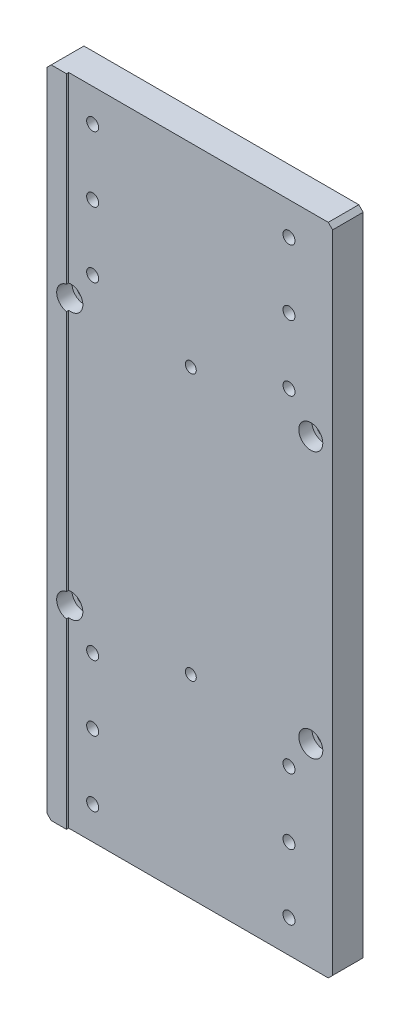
ISO-10303-21;
HEADER;
FILE_DESCRIPTION(('STEP AP214'),'2;1');
FILE_NAME('part.step','',(''),(''),'','','');
FILE_SCHEMA(('AUTOMOTIVE_DESIGN { 1 0 10303 214 1 1 1 1 }'));
ENDSEC;
DATA;
#1=APPLICATION_CONTEXT('core data for automotive mechanical design processes');
#2=APPLICATION_PROTOCOL_DEFINITION('international standard','automotive_design',2000,#1);
#3=PRODUCT_CONTEXT('',#1,'mechanical');
#4=PRODUCT('Part','Part','',(#3));
#5=PRODUCT_RELATED_PRODUCT_CATEGORY('part','',(#4));
#6=PRODUCT_DEFINITION_FORMATION('','',#4);
#7=PRODUCT_DEFINITION_CONTEXT('part definition',#1,'design');
#8=PRODUCT_DEFINITION('design','',#6,#7);
#9=PRODUCT_DEFINITION_SHAPE('','',#8);
#10=(LENGTH_UNIT() NAMED_UNIT(*) SI_UNIT(.MILLI.,.METRE.));
#11=(NAMED_UNIT(*) PLANE_ANGLE_UNIT() SI_UNIT($,.RADIAN.));
#12=(NAMED_UNIT(*) SI_UNIT($,.STERADIAN.) SOLID_ANGLE_UNIT());
#13=UNCERTAINTY_MEASURE_WITH_UNIT(LENGTH_MEASURE(1.E-05),#10,'distance_accuracy_value','');
#14=(GEOMETRIC_REPRESENTATION_CONTEXT(3) GLOBAL_UNCERTAINTY_ASSIGNED_CONTEXT((#13)) GLOBAL_UNIT_ASSIGNED_CONTEXT((#10,
#11,#12)) REPRESENTATION_CONTEXT('',''));
#15=CARTESIAN_POINT('',(0.,0.,0.));
#16=DIRECTION('',(0.,0.,1.));
#17=DIRECTION('',(1.,0.,0.));
#18=AXIS2_PLACEMENT_3D('',#15,#16,#17);
#19=CARTESIAN_POINT('',(-56.,150.,6.5));
#20=DIRECTION('',(-1.,0.,0.));
#21=DIRECTION('',(0.,-1.,0.));
#22=AXIS2_PLACEMENT_3D('',#19,#20,#21);
#23=PLANE('',#22);
#24=DIRECTION('',(0.,-1.,0.));
#25=VECTOR('',#24,1.);
#26=CARTESIAN_POINT('',(-56.,150.,6.5));
#27=LINE('',#26,#25);
#28=CARTESIAN_POINT('',(-56.,55.591673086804,6.5));
#29=VERTEX_POINT('',#28);
#30=CARTESIAN_POINT('',(-56.,-55.591673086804,6.5));
#31=VERTEX_POINT('',#30);
#32=EDGE_CURVE('E166',#29,#31,#27,.T.);
#33=ORIENTED_EDGE('',*,*,#32,.F.);
#34=DIRECTION('',(0.,0.,1.));
#35=VECTOR('',#34,1.);
#36=CARTESIAN_POINT('',(-56.,55.591673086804,7.5));
#37=LINE('',#36,#35);
#38=CARTESIAN_POINT('',(-56.,55.591673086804,7.5));
#39=VERTEX_POINT('',#38);
#40=EDGE_CURVE('E147',#29,#39,#37,.T.);
#41=ORIENTED_EDGE('',*,*,#40,.T.);
#42=DIRECTION('',(0.,-1.,0.));
#43=VECTOR('',#42,1.);
#44=CARTESIAN_POINT('',(-56.,150.,7.5));
#45=LINE('',#44,#43);
#46=CARTESIAN_POINT('',(-56.,-55.591673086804,7.5));
#47=VERTEX_POINT('',#46);
#48=EDGE_CURVE('E156',#39,#47,#45,.T.);
#49=ORIENTED_EDGE('',*,*,#48,.T.);
#50=DIRECTION('',(0.,0.,1.));
#51=VECTOR('',#50,1.);
#52=CARTESIAN_POINT('',(-56.,-55.591673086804,7.5));
#53=LINE('',#52,#51);
#54=EDGE_CURVE('E190',#47,#31,#53,.F.);
#55=ORIENTED_EDGE('',*,*,#54,.T.);
#56=EDGE_LOOP('',(#33,#41,#49,#55));
#57=FACE_BOUND('',#56,.T.);
#58=ADVANCED_FACE('F33',(#57),#23,.F.);
#59=CARTESIAN_POINT('',(-56.,-66.408326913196,6.5));
#60=VERTEX_POINT('',#59);
#61=CARTESIAN_POINT('',(-56.,-150.,6.5));
#62=VERTEX_POINT('',#61);
#63=EDGE_CURVE('E163',#60,#62,#27,.T.);
#64=ORIENTED_EDGE('',*,*,#63,.F.);
#65=DIRECTION('',(0.,0.,1.));
#66=VECTOR('',#65,1.);
#67=CARTESIAN_POINT('',(-56.,-66.408326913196,7.5));
#68=LINE('',#67,#66);
#69=CARTESIAN_POINT('',(-56.,-66.408326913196,7.5));
#70=VERTEX_POINT('',#69);
#71=EDGE_CURVE('E193',#60,#70,#68,.T.);
#72=ORIENTED_EDGE('',*,*,#71,.T.);
#73=CARTESIAN_POINT('',(-56.,-150.,7.5));
#74=VERTEX_POINT('',#73);
#75=EDGE_CURVE('E165',#70,#74,#45,.T.);
#76=ORIENTED_EDGE('',*,*,#75,.T.);
#77=DIRECTION('',(0.,0.,1.));
#78=VECTOR('',#77,1.);
#79=CARTESIAN_POINT('',(-56.,-150.,6.5));
#80=LINE('',#79,#78);
#81=EDGE_CURVE('E269',#62,#74,#80,.T.);
#82=ORIENTED_EDGE('',*,*,#81,.F.);
#83=EDGE_LOOP('',(#64,#72,#76,#82));
#84=FACE_BOUND('',#83,.T.);
#85=ADVANCED_FACE('F516',(#84),#23,.F.);
#86=CARTESIAN_POINT('',(65.,150.,7.5));
#87=DIRECTION('',(-1.,0.,0.));
#88=DIRECTION('',(0.,-1.,0.));
#89=AXIS2_PLACEMENT_3D('',#86,#87,#88);
#90=PLANE('',#89);
#91=DIRECTION('',(0.,1.,0.));
#92=VECTOR('',#91,1.);
#93=CARTESIAN_POINT('',(65.,150.,6.5));
#94=LINE('',#93,#92);
#95=CARTESIAN_POINT('',(65.,-148.,6.5));
#96=VERTEX_POINT('',#95);
#97=CARTESIAN_POINT('',(65.,148.,6.5));
#98=VERTEX_POINT('',#97);
#99=EDGE_CURVE('E289',#96,#98,#94,.T.);
#100=ORIENTED_EDGE('',*,*,#99,.F.);
#101=DIRECTION('',(0.,0.,-1.));
#102=VECTOR('',#101,1.);
#103=CARTESIAN_POINT('',(65.,-148.,7.5));
#104=LINE('',#103,#102);
#105=CARTESIAN_POINT('',(65.,-148.,-7.5));
#106=VERTEX_POINT('',#105);
#107=EDGE_CURVE('E232',#96,#106,#104,.T.);
#108=ORIENTED_EDGE('',*,*,#107,.T.);
#109=DIRECTION('',(0.,1.,0.));
#110=VECTOR('',#109,1.);
#111=CARTESIAN_POINT('',(65.,150.,-7.5));
#112=LINE('',#111,#110);
#113=CARTESIAN_POINT('',(65.,148.,-7.5));
#114=VERTEX_POINT('',#113);
#115=EDGE_CURVE('E281',#106,#114,#112,.T.);
#116=ORIENTED_EDGE('',*,*,#115,.T.);
#117=DIRECTION('',(0.,0.,1.));
#118=VECTOR('',#117,1.);
#119=CARTESIAN_POINT('',(65.,148.,7.5));
#120=LINE('',#119,#118);
#121=EDGE_CURVE('E202',#114,#98,#120,.T.);
#122=ORIENTED_EDGE('',*,*,#121,.T.);
#123=EDGE_LOOP('',(#100,#108,#116,#122));
#124=FACE_BOUND('',#123,.T.);
#125=ADVANCED_FACE('F522',(#124),#90,.F.);
#126=CARTESIAN_POINT('',(-65.,150.,7.5));
#127=DIRECTION('',(0.,-1.,0.));
#128=DIRECTION('',(0.,0.,-1.));
#129=AXIS2_PLACEMENT_3D('',#126,#127,#128);
#130=PLANE('',#129);
#131=DIRECTION('',(-1.,0.,0.));
#132=VECTOR('',#131,1.);
#133=CARTESIAN_POINT('',(-56.,150.,6.5));
#134=LINE('',#133,#132);
#135=CARTESIAN_POINT('',(63.,150.,6.5));
#136=VERTEX_POINT('',#135);
#137=CARTESIAN_POINT('',(-56.,150.,6.5));
#138=VERTEX_POINT('',#137);
#139=EDGE_CURVE('E288',#136,#138,#134,.T.);
#140=ORIENTED_EDGE('',*,*,#139,.F.);
#141=DIRECTION('',(0.,0.,-1.));
#142=VECTOR('',#141,1.);
#143=CARTESIAN_POINT('',(63.,150.,7.5));
#144=LINE('',#143,#142);
#145=CARTESIAN_POINT('',(63.,150.,-7.5));
#146=VERTEX_POINT('',#145);
#147=EDGE_CURVE('E11',#136,#146,#144,.T.);
#148=ORIENTED_EDGE('',*,*,#147,.T.);
#149=DIRECTION('',(-1.,0.,0.));
#150=VECTOR('',#149,1.);
#151=CARTESIAN_POINT('',(-65.,150.,-7.5));
#152=LINE('',#151,#150);
#153=CARTESIAN_POINT('',(-63.,150.,-7.5));
#154=VERTEX_POINT('',#153);
#155=EDGE_CURVE('E279',#146,#154,#152,.T.);
#156=ORIENTED_EDGE('',*,*,#155,.T.);
#157=DIRECTION('',(0.,0.,1.));
#158=VECTOR('',#157,1.);
#159=CARTESIAN_POINT('',(-63.,150.,7.5));
#160=LINE('',#159,#158);
#161=CARTESIAN_POINT('',(-63.,150.,7.5));
#162=VERTEX_POINT('',#161);
#163=EDGE_CURVE('E41',#154,#162,#160,.T.);
#164=ORIENTED_EDGE('',*,*,#163,.T.);
#165=DIRECTION('',(-1.,0.,0.));
#166=VECTOR('',#165,1.);
#167=CARTESIAN_POINT('',(-65.,150.,7.5));
#168=LINE('',#167,#166);
#169=CARTESIAN_POINT('',(-56.,150.,7.5));
#170=VERTEX_POINT('',#169);
#171=EDGE_CURVE('E280',#170,#162,#168,.T.);
#172=ORIENTED_EDGE('',*,*,#171,.F.);
#173=DIRECTION('',(0.,0.,1.));
#174=VECTOR('',#173,1.);
#175=CARTESIAN_POINT('',(-56.,150.,6.5));
#176=LINE('',#175,#174);
#177=EDGE_CURVE('E162',#138,#170,#176,.T.);
#178=ORIENTED_EDGE('',*,*,#177,.F.);
#179=EDGE_LOOP('',(#140,#148,#156,#164,#172,#178));
#180=FACE_BOUND('',#179,.T.);
#181=ADVANCED_FACE('F540',(#180),#130,.F.);
#182=CARTESIAN_POINT('',(-65.,150.,7.5));
#183=DIRECTION('',(1.,0.,0.));
#184=DIRECTION('',(0.,1.,0.));
#185=AXIS2_PLACEMENT_3D('',#182,#183,#184);
#186=PLANE('',#185);
#187=DIRECTION('',(0.,-1.,0.));
#188=VECTOR('',#187,1.);
#189=CARTESIAN_POINT('',(-65.,150.,-7.5));
#190=LINE('',#189,#188);
#191=CARTESIAN_POINT('',(-65.,148.,-7.5));
#192=VERTEX_POINT('',#191);
#193=CARTESIAN_POINT('',(-65.,-148.,-7.5));
#194=VERTEX_POINT('',#193);
#195=EDGE_CURVE('E276',#192,#194,#190,.T.);
#196=ORIENTED_EDGE('',*,*,#195,.T.);
#197=DIRECTION('',(0.,0.,1.));
#198=VECTOR('',#197,1.);
#199=CARTESIAN_POINT('',(-65.,-148.,7.5));
#200=LINE('',#199,#198);
#201=CARTESIAN_POINT('',(-65.,-148.,7.5));
#202=VERTEX_POINT('',#201);
#203=EDGE_CURVE('E55',#194,#202,#200,.T.);
#204=ORIENTED_EDGE('',*,*,#203,.T.);
#205=DIRECTION('',(0.,-1.,0.));
#206=VECTOR('',#205,1.);
#207=CARTESIAN_POINT('',(-65.,150.,7.5));
#208=LINE('',#207,#206);
#209=CARTESIAN_POINT('',(-65.,148.,7.5));
#210=VERTEX_POINT('',#209);
#211=EDGE_CURVE('E261',#210,#202,#208,.T.);
#212=ORIENTED_EDGE('',*,*,#211,.F.);
#213=DIRECTION('',(0.,0.,-1.));
#214=VECTOR('',#213,1.);
#215=CARTESIAN_POINT('',(-65.,148.,7.5));
#216=LINE('',#215,#214);
#217=EDGE_CURVE('E252',#210,#192,#216,.T.);
#218=ORIENTED_EDGE('',*,*,#217,.T.);
#219=EDGE_LOOP('',(#196,#204,#212,#218));
#220=FACE_BOUND('',#219,.T.);
#221=ADVANCED_FACE('F277',(#220),#186,.F.);
#222=CARTESIAN_POINT('',(-65.,-150.,7.5));
#223=DIRECTION('',(0.,1.,0.));
#224=DIRECTION('',(0.,0.,1.));
#225=AXIS2_PLACEMENT_3D('',#222,#223,#224);
#226=PLANE('',#225);
#227=DIRECTION('',(1.,0.,0.));
#228=VECTOR('',#227,1.);
#229=CARTESIAN_POINT('',(-65.,-150.,-7.5));
#230=LINE('',#229,#228);
#231=CARTESIAN_POINT('',(-62.9999999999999,-150.,-7.5));
#232=VERTEX_POINT('',#231);
#233=CARTESIAN_POINT('',(63.0000000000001,-150.,-7.5));
#234=VERTEX_POINT('',#233);
#235=EDGE_CURVE('E188',#232,#234,#230,.T.);
#236=ORIENTED_EDGE('',*,*,#235,.T.);
#237=DIRECTION('',(0.,0.,1.));
#238=VECTOR('',#237,1.);
#239=CARTESIAN_POINT('',(63.0000000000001,-150.,7.5));
#240=LINE('',#239,#238);
#241=CARTESIAN_POINT('',(63.0000000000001,-150.,6.5));
#242=VERTEX_POINT('',#241);
#243=EDGE_CURVE('E246',#234,#242,#240,.T.);
#244=ORIENTED_EDGE('',*,*,#243,.T.);
#245=DIRECTION('',(1.,0.,0.));
#246=VECTOR('',#245,1.);
#247=CARTESIAN_POINT('',(-56.,-150.,6.5));
#248=LINE('',#247,#246);
#249=EDGE_CURVE('E293',#62,#242,#248,.T.);
#250=ORIENTED_EDGE('',*,*,#249,.F.);
#251=ORIENTED_EDGE('',*,*,#81,.T.);
#252=DIRECTION('',(1.,0.,0.));
#253=VECTOR('',#252,1.);
#254=CARTESIAN_POINT('',(-65.,-150.,7.5));
#255=LINE('',#254,#253);
#256=CARTESIAN_POINT('',(-62.9999999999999,-150.,7.5));
#257=VERTEX_POINT('',#256);
#258=EDGE_CURVE('E194',#257,#74,#255,.T.);
#259=ORIENTED_EDGE('',*,*,#258,.F.);
#260=DIRECTION('',(0.,0.,-1.));
#261=VECTOR('',#260,1.);
#262=CARTESIAN_POINT('',(-62.9999999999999,-150.,7.5));
#263=LINE('',#262,#261);
#264=EDGE_CURVE('E243',#257,#232,#263,.T.);
#265=ORIENTED_EDGE('',*,*,#264,.T.);
#266=EDGE_LOOP('',(#236,#244,#250,#251,#259,#265));
#267=FACE_BOUND('',#266,.T.);
#268=ADVANCED_FACE('F266',(#267),#226,.F.);
#269=CARTESIAN_POINT('',(0.,0.,7.5));
#270=DIRECTION('',(0.,0.,1.));
#271=DIRECTION('',(1.,0.,0.));
#272=AXIS2_PLACEMENT_3D('',#269,#270,#271);
#273=PLANE('',#272);
#274=ORIENTED_EDGE('',*,*,#211,.T.);
#275=DIRECTION('',(-0.707106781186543,0.707106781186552,0.));
#276=VECTOR('',#275,1.);
#277=CARTESIAN_POINT('',(-106.5,-106.499999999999,7.5));
#278=LINE('',#277,#276);
#279=EDGE_CURVE('E258',#202,#257,#278,.F.);
#280=ORIENTED_EDGE('',*,*,#279,.T.);
#281=ORIENTED_EDGE('',*,*,#258,.T.);
#282=ORIENTED_EDGE('',*,*,#75,.F.);
#283=CARTESIAN_POINT('',(-55.,-61.,7.5));
#284=DIRECTION('',(0.,0.,1.));
#285=DIRECTION('',(1.,0.,0.));
#286=AXIS2_PLACEMENT_3D('',#283,#284,#285);
#287=CIRCLE('',#286,5.5);
#288=EDGE_CURVE('E199',#47,#70,#287,.T.);
#289=ORIENTED_EDGE('',*,*,#288,.F.);
#290=ORIENTED_EDGE('',*,*,#48,.F.);
#291=CARTESIAN_POINT('',(-55.,61.,7.5));
#292=DIRECTION('',(0.,0.,1.));
#293=DIRECTION('',(1.,0.,0.));
#294=AXIS2_PLACEMENT_3D('',#291,#292,#293);
#295=CIRCLE('',#294,5.5);
#296=CARTESIAN_POINT('',(-56.,66.408326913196,7.5));
#297=VERTEX_POINT('',#296);
#298=EDGE_CURVE('E139',#297,#39,#295,.T.);
#299=ORIENTED_EDGE('',*,*,#298,.F.);
#300=EDGE_CURVE('E154',#170,#297,#45,.T.);
#301=ORIENTED_EDGE('',*,*,#300,.F.);
#302=ORIENTED_EDGE('',*,*,#171,.T.);
#303=DIRECTION('',(0.707106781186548,0.707106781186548,0.));
#304=VECTOR('',#303,1.);
#305=CARTESIAN_POINT('',(-106.5,106.5,7.5));
#306=LINE('',#305,#304);
#307=EDGE_CURVE('E256',#162,#210,#306,.F.);
#308=ORIENTED_EDGE('',*,*,#307,.T.);
#309=EDGE_LOOP('',(#274,#280,#281,#282,#289,#290,#299,#301,#302,#308));
#310=FACE_BOUND('',#309,.T.);
#311=ADVANCED_FACE('F153',(#310),#273,.T.);
#312=CARTESIAN_POINT('',(0.,0.,-7.5));
#313=DIRECTION('',(0.,0.,1.));
#314=DIRECTION('',(1.,0.,0.));
#315=AXIS2_PLACEMENT_3D('',#312,#313,#314);
#316=PLANE('',#315);
#317=CARTESIAN_POINT('',(0.,61.,-7.5));
#318=DIRECTION('',(0.,0.,1.));
#319=DIRECTION('',(1.,0.,0.));
#320=AXIS2_PLACEMENT_3D('',#317,#318,#319);
#321=CIRCLE('',#320,2.5);
#322=CARTESIAN_POINT('',(2.5,61.,-7.5));
#323=VERTEX_POINT('',#322);
#324=EDGE_CURVE('E453',#323,#323,#321,.T.);
#325=ORIENTED_EDGE('',*,*,#324,.T.);
#326=EDGE_LOOP('',(#325));
#327=FACE_BOUND('',#326,.T.);
#328=CARTESIAN_POINT('',(0.,-61.,-7.5));
#329=DIRECTION('',(0.,0.,1.));
#330=DIRECTION('',(1.,0.,0.));
#331=AXIS2_PLACEMENT_3D('',#328,#329,#330);
#332=CIRCLE('',#331,2.5);
#333=CARTESIAN_POINT('',(2.5,-61.,-7.5));
#334=VERTEX_POINT('',#333);
#335=EDGE_CURVE('E447',#334,#334,#332,.T.);
#336=ORIENTED_EDGE('',*,*,#335,.T.);
#337=EDGE_LOOP('',(#336));
#338=FACE_BOUND('',#337,.T.);
#339=CARTESIAN_POINT('',(45.,-105.,-7.5));
#340=DIRECTION('',(0.,0.,-1.));
#341=DIRECTION('',(-1.,0.,0.));
#342=AXIS2_PLACEMENT_3D('',#339,#340,#341);
#343=CIRCLE('',#342,4.75);
#344=CARTESIAN_POINT('',(40.25,-105.,-7.5));
#345=VERTEX_POINT('',#344);
#346=EDGE_CURVE('E444',#345,#345,#343,.T.);
#347=ORIENTED_EDGE('',*,*,#346,.F.);
#348=EDGE_LOOP('',(#347));
#349=FACE_BOUND('',#348,.T.);
#350=CARTESIAN_POINT('',(-45.,-105.,-7.5));
#351=DIRECTION('',(0.,0.,-1.));
#352=DIRECTION('',(-1.,0.,0.));
#353=AXIS2_PLACEMENT_3D('',#350,#351,#352);
#354=CIRCLE('',#353,4.75);
#355=CARTESIAN_POINT('',(-49.75,-105.,-7.5));
#356=VERTEX_POINT('',#355);
#357=EDGE_CURVE('E432',#356,#356,#354,.T.);
#358=ORIENTED_EDGE('',*,*,#357,.F.);
#359=EDGE_LOOP('',(#358));
#360=FACE_BOUND('',#359,.T.);
#361=CARTESIAN_POINT('',(-45.,-75.,-7.5));
#362=DIRECTION('',(0.,0.,-1.));
#363=DIRECTION('',(-1.,0.,0.));
#364=AXIS2_PLACEMENT_3D('',#361,#362,#363);
#365=CIRCLE('',#364,4.75);
#366=CARTESIAN_POINT('',(-49.75,-75.,-7.5));
#367=VERTEX_POINT('',#366);
#368=EDGE_CURVE('E420',#367,#367,#365,.T.);
#369=ORIENTED_EDGE('',*,*,#368,.F.);
#370=EDGE_LOOP('',(#369));
#371=FACE_BOUND('',#370,.T.);
#372=CARTESIAN_POINT('',(45.,-135.,-7.5));
#373=DIRECTION('',(0.,0.,-1.));
#374=DIRECTION('',(-1.,0.,0.));
#375=AXIS2_PLACEMENT_3D('',#372,#373,#374);
#376=CIRCLE('',#375,4.75);
#377=CARTESIAN_POINT('',(40.25,-135.,-7.5));
#378=VERTEX_POINT('',#377);
#379=EDGE_CURVE('E408',#378,#378,#376,.T.);
#380=ORIENTED_EDGE('',*,*,#379,.F.);
#381=EDGE_LOOP('',(#380));
#382=FACE_BOUND('',#381,.T.);
#383=CARTESIAN_POINT('',(-45.,-135.,-7.5));
#384=DIRECTION('',(0.,0.,-1.));
#385=DIRECTION('',(-1.,0.,0.));
#386=AXIS2_PLACEMENT_3D('',#383,#384,#385);
#387=CIRCLE('',#386,4.75);
#388=CARTESIAN_POINT('',(-49.75,-135.,-7.5));
#389=VERTEX_POINT('',#388);
#390=EDGE_CURVE('E396',#389,#389,#387,.T.);
#391=ORIENTED_EDGE('',*,*,#390,.F.);
#392=EDGE_LOOP('',(#391));
#393=FACE_BOUND('',#392,.T.);
#394=CARTESIAN_POINT('',(45.,-75.,-7.5));
#395=DIRECTION('',(0.,0.,-1.));
#396=DIRECTION('',(-1.,0.,0.));
#397=AXIS2_PLACEMENT_3D('',#394,#395,#396);
#398=CIRCLE('',#397,4.75);
#399=CARTESIAN_POINT('',(40.25,-75.,-7.5));
#400=VERTEX_POINT('',#399);
#401=EDGE_CURVE('E384',#400,#400,#398,.T.);
#402=ORIENTED_EDGE('',*,*,#401,.F.);
#403=EDGE_LOOP('',(#402));
#404=FACE_BOUND('',#403,.T.);
#405=CARTESIAN_POINT('',(45.,135.,-7.5));
#406=DIRECTION('',(0.,0.,-1.));
#407=DIRECTION('',(-1.,0.,0.));
#408=AXIS2_PLACEMENT_3D('',#405,#406,#407);
#409=CIRCLE('',#408,4.75);
#410=CARTESIAN_POINT('',(40.25,135.,-7.5));
#411=VERTEX_POINT('',#410);
#412=EDGE_CURVE('E372',#411,#411,#409,.T.);
#413=ORIENTED_EDGE('',*,*,#412,.F.);
#414=EDGE_LOOP('',(#413));
#415=FACE_BOUND('',#414,.T.);
#416=CARTESIAN_POINT('',(45.,105.,-7.5));
#417=DIRECTION('',(0.,0.,-1.));
#418=DIRECTION('',(-1.,0.,0.));
#419=AXIS2_PLACEMENT_3D('',#416,#417,#418);
#420=CIRCLE('',#419,4.75);
#421=CARTESIAN_POINT('',(40.25,105.,-7.5));
#422=VERTEX_POINT('',#421);
#423=EDGE_CURVE('E229',#422,#422,#420,.T.);
#424=ORIENTED_EDGE('',*,*,#423,.F.);
#425=EDGE_LOOP('',(#424));
#426=FACE_BOUND('',#425,.T.);
#427=CARTESIAN_POINT('',(-45.,105.,-7.5));
#428=DIRECTION('',(0.,0.,-1.));
#429=DIRECTION('',(-1.,0.,0.));
#430=AXIS2_PLACEMENT_3D('',#427,#428,#429);
#431=CIRCLE('',#430,4.75);
#432=CARTESIAN_POINT('',(-49.75,105.,-7.5));
#433=VERTEX_POINT('',#432);
#434=EDGE_CURVE('E224',#433,#433,#431,.T.);
#435=ORIENTED_EDGE('',*,*,#434,.F.);
#436=EDGE_LOOP('',(#435));
#437=FACE_BOUND('',#436,.T.);
#438=CARTESIAN_POINT('',(-45.,135.,-7.5));
#439=DIRECTION('',(0.,0.,-1.));
#440=DIRECTION('',(-1.,0.,0.));
#441=AXIS2_PLACEMENT_3D('',#438,#439,#440);
#442=CIRCLE('',#441,4.75);
#443=CARTESIAN_POINT('',(-49.75,135.,-7.5));
#444=VERTEX_POINT('',#443);
#445=EDGE_CURVE('E219',#444,#444,#442,.T.);
#446=ORIENTED_EDGE('',*,*,#445,.F.);
#447=EDGE_LOOP('',(#446));
#448=FACE_BOUND('',#447,.T.);
#449=CARTESIAN_POINT('',(45.,75.,-7.5));
#450=DIRECTION('',(0.,0.,-1.));
#451=DIRECTION('',(-1.,0.,0.));
#452=AXIS2_PLACEMENT_3D('',#449,#450,#451);
#453=CIRCLE('',#452,4.75);
#454=CARTESIAN_POINT('',(40.25,75.,-7.5));
#455=VERTEX_POINT('',#454);
#456=EDGE_CURVE('E214',#455,#455,#453,.T.);
#457=ORIENTED_EDGE('',*,*,#456,.F.);
#458=EDGE_LOOP('',(#457));
#459=FACE_BOUND('',#458,.T.);
#460=CARTESIAN_POINT('',(-45.,75.,-7.5));
#461=DIRECTION('',(0.,0.,-1.));
#462=DIRECTION('',(-1.,0.,0.));
#463=AXIS2_PLACEMENT_3D('',#460,#461,#462);
#464=CIRCLE('',#463,4.75);
#465=CARTESIAN_POINT('',(-49.75,75.,-7.5));
#466=VERTEX_POINT('',#465);
#467=EDGE_CURVE('E209',#466,#466,#464,.T.);
#468=ORIENTED_EDGE('',*,*,#467,.F.);
#469=EDGE_LOOP('',(#468));
#470=FACE_BOUND('',#469,.T.);
#471=CARTESIAN_POINT('',(-55.,61.,-7.5));
#472=DIRECTION('',(0.,0.,1.));
#473=DIRECTION('',(1.,0.,0.));
#474=AXIS2_PLACEMENT_3D('',#471,#472,#473);
#475=CIRCLE('',#474,3.3);
#476=CARTESIAN_POINT('',(-51.7,61.,-7.5));
#477=VERTEX_POINT('',#476);
#478=EDGE_CURVE('E148',#477,#477,#475,.T.);
#479=ORIENTED_EDGE('',*,*,#478,.T.);
#480=EDGE_LOOP('',(#479));
#481=FACE_BOUND('',#480,.T.);
#482=CARTESIAN_POINT('',(55.,61.,-7.5));
#483=DIRECTION('',(0.,0.,1.));
#484=DIRECTION('',(1.,0.,0.));
#485=AXIS2_PLACEMENT_3D('',#482,#483,#484);
#486=CIRCLE('',#485,3.3);
#487=CARTESIAN_POINT('',(58.3,61.,-7.5));
#488=VERTEX_POINT('',#487);
#489=EDGE_CURVE('E200',#488,#488,#486,.T.);
#490=ORIENTED_EDGE('',*,*,#489,.T.);
#491=EDGE_LOOP('',(#490));
#492=FACE_BOUND('',#491,.T.);
#493=CARTESIAN_POINT('',(-55.,-61.,-7.5));
#494=DIRECTION('',(0.,0.,1.));
#495=DIRECTION('',(1.,0.,0.));
#496=AXIS2_PLACEMENT_3D('',#493,#494,#495);
#497=CIRCLE('',#496,3.3);
#498=CARTESIAN_POINT('',(-51.7,-61.,-7.5));
#499=VERTEX_POINT('',#498);
#500=EDGE_CURVE('E306',#499,#499,#497,.T.);
#501=ORIENTED_EDGE('',*,*,#500,.T.);
#502=EDGE_LOOP('',(#501));
#503=FACE_BOUND('',#502,.T.);
#504=CARTESIAN_POINT('',(55.,-61.,-7.5));
#505=DIRECTION('',(0.,0.,1.));
#506=DIRECTION('',(1.,0.,0.));
#507=AXIS2_PLACEMENT_3D('',#504,#505,#506);
#508=CIRCLE('',#507,3.3);
#509=CARTESIAN_POINT('',(58.3,-61.,-7.5));
#510=VERTEX_POINT('',#509);
#511=EDGE_CURVE('E179',#510,#510,#508,.T.);
#512=ORIENTED_EDGE('',*,*,#511,.T.);
#513=EDGE_LOOP('',(#512));
#514=FACE_BOUND('',#513,.T.);
#515=ORIENTED_EDGE('',*,*,#115,.F.);
#516=DIRECTION('',(0.70710678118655,0.707106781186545,0.));
#517=VECTOR('',#516,1.);
#518=CARTESIAN_POINT('',(65.,-148.,-7.5));
#519=LINE('',#518,#517);
#520=EDGE_CURVE('E241',#106,#234,#519,.F.);
#521=ORIENTED_EDGE('',*,*,#520,.T.);
#522=ORIENTED_EDGE('',*,*,#235,.F.);
#523=DIRECTION('',(0.707106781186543,-0.707106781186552,0.));
#524=VECTOR('',#523,1.);
#525=CARTESIAN_POINT('',(-62.9999999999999,-150.,-7.5));
#526=LINE('',#525,#524);
#527=EDGE_CURVE('E239',#232,#194,#526,.F.);
#528=ORIENTED_EDGE('',*,*,#527,.T.);
#529=ORIENTED_EDGE('',*,*,#195,.F.);
#530=DIRECTION('',(-0.707106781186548,-0.707106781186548,0.));
#531=VECTOR('',#530,1.);
#532=CARTESIAN_POINT('',(-65.,148.,-7.5));
#533=LINE('',#532,#531);
#534=EDGE_CURVE('E235',#192,#154,#533,.F.);
#535=ORIENTED_EDGE('',*,*,#534,.T.);
#536=ORIENTED_EDGE('',*,*,#155,.F.);
#537=DIRECTION('',(-0.707106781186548,0.707106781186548,0.));
#538=VECTOR('',#537,1.);
#539=CARTESIAN_POINT('',(63.,150.,-7.5));
#540=LINE('',#539,#538);
#541=EDGE_CURVE('E237',#146,#114,#540,.F.);
#542=ORIENTED_EDGE('',*,*,#541,.T.);
#543=EDGE_LOOP('',(#515,#521,#522,#528,#529,#535,#536,#542));
#544=FACE_BOUND('',#543,.T.);
#545=ADVANCED_FACE('F275',(#327,#338,#349,#360,#371,#382,#393,#404,#415,#426,#437,#448,#459,
#470,#481,#492,#503,#514,#544),#316,.F.);
#546=ORIENTED_EDGE('',*,*,#300,.T.);
#547=DIRECTION('',(0.,0.,1.));
#548=VECTOR('',#547,1.);
#549=CARTESIAN_POINT('',(-56.,66.408326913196,7.5));
#550=LINE('',#549,#548);
#551=CARTESIAN_POINT('',(-56.,66.408326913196,6.5));
#552=VERTEX_POINT('',#551);
#553=EDGE_CURVE('E136',#297,#552,#550,.F.);
#554=ORIENTED_EDGE('',*,*,#553,.T.);
#555=EDGE_CURVE('E168',#138,#552,#27,.T.);
#556=ORIENTED_EDGE('',*,*,#555,.F.);
#557=ORIENTED_EDGE('',*,*,#177,.T.);
#558=EDGE_LOOP('',(#546,#554,#556,#557));
#559=FACE_BOUND('',#558,.T.);
#560=ADVANCED_FACE('F160',(#559),#23,.F.);
#561=CARTESIAN_POINT('',(0.,0.,6.5));
#562=DIRECTION('',(0.,0.,1.));
#563=DIRECTION('',(1.,0.,0.));
#564=AXIS2_PLACEMENT_3D('',#561,#562,#563);
#565=PLANE('',#564);
#566=CARTESIAN_POINT('',(0.,61.,6.5));
#567=DIRECTION('',(0.,0.,1.));
#568=DIRECTION('',(1.,0.,0.));
#569=AXIS2_PLACEMENT_3D('',#566,#567,#568);
#570=CIRCLE('',#569,2.49999999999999);
#571=CARTESIAN_POINT('',(2.49999999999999,61.,6.5));
#572=VERTEX_POINT('',#571);
#573=EDGE_CURVE('E456',#572,#572,#570,.T.);
#574=ORIENTED_EDGE('',*,*,#573,.F.);
#575=EDGE_LOOP('',(#574));
#576=FACE_BOUND('',#575,.T.);
#577=CARTESIAN_POINT('',(0.,-61.,6.5));
#578=DIRECTION('',(0.,0.,1.));
#579=DIRECTION('',(1.,0.,0.));
#580=AXIS2_PLACEMENT_3D('',#577,#578,#579);
#581=CIRCLE('',#580,2.49999999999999);
#582=CARTESIAN_POINT('',(2.49999999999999,-61.,6.5));
#583=VERTEX_POINT('',#582);
#584=EDGE_CURVE('E450',#583,#583,#581,.T.);
#585=ORIENTED_EDGE('',*,*,#584,.F.);
#586=EDGE_LOOP('',(#585));
#587=FACE_BOUND('',#586,.T.);
#588=CARTESIAN_POINT('',(45.,-105.,6.5));
#589=DIRECTION('',(0.,0.,1.));
#590=DIRECTION('',(1.,0.,0.));
#591=AXIS2_PLACEMENT_3D('',#588,#589,#590);
#592=CIRCLE('',#591,2.75);
#593=CARTESIAN_POINT('',(47.75,-105.,6.5));
#594=VERTEX_POINT('',#593);
#595=EDGE_CURVE('E441',#594,#594,#592,.T.);
#596=ORIENTED_EDGE('',*,*,#595,.F.);
#597=EDGE_LOOP('',(#596));
#598=FACE_BOUND('',#597,.T.);
#599=CARTESIAN_POINT('',(-45.,-105.,6.5));
#600=DIRECTION('',(0.,0.,1.));
#601=DIRECTION('',(1.,0.,0.));
#602=AXIS2_PLACEMENT_3D('',#599,#600,#601);
#603=CIRCLE('',#602,2.75);
#604=CARTESIAN_POINT('',(-42.25,-105.,6.5));
#605=VERTEX_POINT('',#604);
#606=EDGE_CURVE('E429',#605,#605,#603,.T.);
#607=ORIENTED_EDGE('',*,*,#606,.F.);
#608=EDGE_LOOP('',(#607));
#609=FACE_BOUND('',#608,.T.);
#610=CARTESIAN_POINT('',(-45.,-75.,6.5));
#611=DIRECTION('',(0.,0.,1.));
#612=DIRECTION('',(1.,0.,0.));
#613=AXIS2_PLACEMENT_3D('',#610,#611,#612);
#614=CIRCLE('',#613,2.75);
#615=CARTESIAN_POINT('',(-42.25,-75.,6.5));
#616=VERTEX_POINT('',#615);
#617=EDGE_CURVE('E417',#616,#616,#614,.T.);
#618=ORIENTED_EDGE('',*,*,#617,.F.);
#619=EDGE_LOOP('',(#618));
#620=FACE_BOUND('',#619,.T.);
#621=CARTESIAN_POINT('',(45.,-135.,6.5));
#622=DIRECTION('',(0.,0.,1.));
#623=DIRECTION('',(1.,0.,0.));
#624=AXIS2_PLACEMENT_3D('',#621,#622,#623);
#625=CIRCLE('',#624,2.75);
#626=CARTESIAN_POINT('',(47.75,-135.,6.5));
#627=VERTEX_POINT('',#626);
#628=EDGE_CURVE('E405',#627,#627,#625,.T.);
#629=ORIENTED_EDGE('',*,*,#628,.F.);
#630=EDGE_LOOP('',(#629));
#631=FACE_BOUND('',#630,.T.);
#632=CARTESIAN_POINT('',(-45.,-135.,6.5));
#633=DIRECTION('',(0.,0.,1.));
#634=DIRECTION('',(1.,0.,0.));
#635=AXIS2_PLACEMENT_3D('',#632,#633,#634);
#636=CIRCLE('',#635,2.75);
#637=CARTESIAN_POINT('',(-42.25,-135.,6.5));
#638=VERTEX_POINT('',#637);
#639=EDGE_CURVE('E393',#638,#638,#636,.T.);
#640=ORIENTED_EDGE('',*,*,#639,.F.);
#641=EDGE_LOOP('',(#640));
#642=FACE_BOUND('',#641,.T.);
#643=CARTESIAN_POINT('',(45.,-75.,6.5));
#644=DIRECTION('',(0.,0.,1.));
#645=DIRECTION('',(1.,0.,0.));
#646=AXIS2_PLACEMENT_3D('',#643,#644,#645);
#647=CIRCLE('',#646,2.75);
#648=CARTESIAN_POINT('',(47.75,-75.,6.5));
#649=VERTEX_POINT('',#648);
#650=EDGE_CURVE('E381',#649,#649,#647,.T.);
#651=ORIENTED_EDGE('',*,*,#650,.F.);
#652=EDGE_LOOP('',(#651));
#653=FACE_BOUND('',#652,.T.);
#654=CARTESIAN_POINT('',(45.,135.,6.5));
#655=DIRECTION('',(0.,0.,1.));
#656=DIRECTION('',(1.,0.,0.));
#657=AXIS2_PLACEMENT_3D('',#654,#655,#656);
#658=CIRCLE('',#657,2.75);
#659=CARTESIAN_POINT('',(47.75,135.,6.5));
#660=VERTEX_POINT('',#659);
#661=EDGE_CURVE('E226',#660,#660,#658,.T.);
#662=ORIENTED_EDGE('',*,*,#661,.F.);
#663=EDGE_LOOP('',(#662));
#664=FACE_BOUND('',#663,.T.);
#665=CARTESIAN_POINT('',(45.,105.,6.5));
#666=DIRECTION('',(0.,0.,1.));
#667=DIRECTION('',(1.,0.,0.));
#668=AXIS2_PLACEMENT_3D('',#665,#666,#667);
#669=CIRCLE('',#668,2.75);
#670=CARTESIAN_POINT('',(47.75,105.,6.5));
#671=VERTEX_POINT('',#670);
#672=EDGE_CURVE('E221',#671,#671,#669,.T.);
#673=ORIENTED_EDGE('',*,*,#672,.F.);
#674=EDGE_LOOP('',(#673));
#675=FACE_BOUND('',#674,.T.);
#676=CARTESIAN_POINT('',(-45.,105.,6.5));
#677=DIRECTION('',(0.,0.,1.));
#678=DIRECTION('',(1.,0.,0.));
#679=AXIS2_PLACEMENT_3D('',#676,#677,#678);
#680=CIRCLE('',#679,2.75);
#681=CARTESIAN_POINT('',(-42.25,105.,6.5));
#682=VERTEX_POINT('',#681);
#683=EDGE_CURVE('E216',#682,#682,#680,.T.);
#684=ORIENTED_EDGE('',*,*,#683,.F.);
#685=EDGE_LOOP('',(#684));
#686=FACE_BOUND('',#685,.T.);
#687=CARTESIAN_POINT('',(-45.,135.,6.5));
#688=DIRECTION('',(0.,0.,1.));
#689=DIRECTION('',(1.,0.,0.));
#690=AXIS2_PLACEMENT_3D('',#687,#688,#689);
#691=CIRCLE('',#690,2.75);
#692=CARTESIAN_POINT('',(-42.25,135.,6.5));
#693=VERTEX_POINT('',#692);
#694=EDGE_CURVE('E211',#693,#693,#691,.T.);
#695=ORIENTED_EDGE('',*,*,#694,.F.);
#696=EDGE_LOOP('',(#695));
#697=FACE_BOUND('',#696,.T.);
#698=CARTESIAN_POINT('',(45.,75.,6.5));
#699=DIRECTION('',(0.,0.,1.));
#700=DIRECTION('',(1.,0.,0.));
#701=AXIS2_PLACEMENT_3D('',#698,#699,#700);
#702=CIRCLE('',#701,2.75);
#703=CARTESIAN_POINT('',(47.75,75.,6.5));
#704=VERTEX_POINT('',#703);
#705=EDGE_CURVE('E206',#704,#704,#702,.T.);
#706=ORIENTED_EDGE('',*,*,#705,.F.);
#707=EDGE_LOOP('',(#706));
#708=FACE_BOUND('',#707,.T.);
#709=CARTESIAN_POINT('',(-45.,75.,6.5));
#710=DIRECTION('',(0.,0.,1.));
#711=DIRECTION('',(1.,0.,0.));
#712=AXIS2_PLACEMENT_3D('',#709,#710,#711);
#713=CIRCLE('',#712,2.75);
#714=CARTESIAN_POINT('',(-42.25,75.,6.5));
#715=VERTEX_POINT('',#714);
#716=EDGE_CURVE('E158',#715,#715,#713,.T.);
#717=ORIENTED_EDGE('',*,*,#716,.F.);
#718=EDGE_LOOP('',(#717));
#719=FACE_BOUND('',#718,.T.);
#720=ORIENTED_EDGE('',*,*,#249,.T.);
#721=DIRECTION('',(-0.70710678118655,-0.707106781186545,0.));
#722=VECTOR('',#721,1.);
#723=CARTESIAN_POINT('',(106.5,-106.500000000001,6.5));
#724=LINE('',#723,#722);
#725=EDGE_CURVE('E250',#242,#96,#724,.F.);
#726=ORIENTED_EDGE('',*,*,#725,.T.);
#727=ORIENTED_EDGE('',*,*,#99,.T.);
#728=DIRECTION('',(0.707106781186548,-0.707106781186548,0.));
#729=VECTOR('',#728,1.);
#730=CARTESIAN_POINT('',(106.5,106.5,6.5));
#731=LINE('',#730,#729);
#732=EDGE_CURVE('E248',#98,#136,#731,.F.);
#733=ORIENTED_EDGE('',*,*,#732,.T.);
#734=ORIENTED_EDGE('',*,*,#139,.T.);
#735=ORIENTED_EDGE('',*,*,#555,.T.);
#736=CARTESIAN_POINT('',(-55.,61.,6.5));
#737=DIRECTION('',(0.,0.,1.));
#738=DIRECTION('',(1.,0.,0.));
#739=AXIS2_PLACEMENT_3D('',#736,#737,#738);
#740=CIRCLE('',#739,5.5);
#741=EDGE_CURVE('E142',#29,#552,#740,.T.);
#742=ORIENTED_EDGE('',*,*,#741,.F.);
#743=ORIENTED_EDGE('',*,*,#32,.T.);
#744=CARTESIAN_POINT('',(-55.,-61.,6.5));
#745=DIRECTION('',(0.,0.,1.));
#746=DIRECTION('',(1.,0.,0.));
#747=AXIS2_PLACEMENT_3D('',#744,#745,#746);
#748=CIRCLE('',#747,5.5);
#749=EDGE_CURVE('E303',#60,#31,#748,.T.);
#750=ORIENTED_EDGE('',*,*,#749,.F.);
#751=ORIENTED_EDGE('',*,*,#63,.T.);
#752=EDGE_LOOP('',(#720,#726,#727,#733,#734,#735,#742,#743,#750,#751));
#753=FACE_BOUND('',#752,.T.);
#754=CARTESIAN_POINT('',(55.,61.,6.5));
#755=DIRECTION('',(0.,0.,1.));
#756=DIRECTION('',(1.,0.,0.));
#757=AXIS2_PLACEMENT_3D('',#754,#755,#756);
#758=CIRCLE('',#757,5.5);
#759=CARTESIAN_POINT('',(60.5,61.,6.5));
#760=VERTEX_POINT('',#759);
#761=EDGE_CURVE('E196',#760,#760,#758,.T.);
#762=ORIENTED_EDGE('',*,*,#761,.F.);
#763=EDGE_LOOP('',(#762));
#764=FACE_BOUND('',#763,.T.);
#765=CARTESIAN_POINT('',(55.,-61.,6.5));
#766=DIRECTION('',(0.,0.,1.));
#767=DIRECTION('',(1.,0.,0.));
#768=AXIS2_PLACEMENT_3D('',#765,#766,#767);
#769=CIRCLE('',#768,5.5);
#770=CARTESIAN_POINT('',(60.5,-61.,6.5));
#771=VERTEX_POINT('',#770);
#772=EDGE_CURVE('E172',#771,#771,#769,.T.);
#773=ORIENTED_EDGE('',*,*,#772,.F.);
#774=EDGE_LOOP('',(#773));
#775=FACE_BOUND('',#774,.T.);
#776=ADVANCED_FACE('F462',(#576,#587,#598,#609,#620,#631,#642,#653,#664,#675,#686,#697,#708,
#719,#753,#764,#775),#565,.T.);
#777=CARTESIAN_POINT('',(55.,-61.,7.5));
#778=DIRECTION('',(0.,0.,1.));
#779=DIRECTION('',(1.,0.,0.));
#780=AXIS2_PLACEMENT_3D('',#777,#778,#779);
#781=CYLINDRICAL_SURFACE('',#780,3.3);
#782=ORIENTED_EDGE('',*,*,#511,.F.);
#783=EDGE_LOOP('',(#782));
#784=FACE_BOUND('',#783,.T.);
#785=CARTESIAN_POINT('',(55.,-61.,0.5));
#786=DIRECTION('',(0.,0.,1.));
#787=DIRECTION('',(1.,0.,0.));
#788=AXIS2_PLACEMENT_3D('',#785,#786,#787);
#789=CIRCLE('',#788,3.3);
#790=CARTESIAN_POINT('',(58.3,-61.,0.5));
#791=VERTEX_POINT('',#790);
#792=EDGE_CURVE('E184',#791,#791,#789,.T.);
#793=ORIENTED_EDGE('',*,*,#792,.T.);
#794=EDGE_LOOP('',(#793));
#795=FACE_BOUND('',#794,.T.);
#796=ADVANCED_FACE('F465',(#784,#795),#781,.F.);
#797=CARTESIAN_POINT('',(58.3,-61.,0.5));
#798=DIRECTION('',(0.,0.,-1.));
#799=DIRECTION('',(-1.,0.,0.));
#800=AXIS2_PLACEMENT_3D('',#797,#798,#799);
#801=PLANE('',#800);
#802=ORIENTED_EDGE('',*,*,#792,.F.);
#803=EDGE_LOOP('',(#802));
#804=FACE_BOUND('',#803,.T.);
#805=CARTESIAN_POINT('',(55.,-61.,0.5));
#806=DIRECTION('',(0.,0.,1.));
#807=DIRECTION('',(1.,0.,0.));
#808=AXIS2_PLACEMENT_3D('',#805,#806,#807);
#809=CIRCLE('',#808,5.5);
#810=CARTESIAN_POINT('',(60.5,-61.,0.5));
#811=VERTEX_POINT('',#810);
#812=EDGE_CURVE('E300',#811,#811,#809,.T.);
#813=ORIENTED_EDGE('',*,*,#812,.T.);
#814=EDGE_LOOP('',(#813));
#815=FACE_BOUND('',#814,.T.);
#816=ADVANCED_FACE('F1090',(#804,#815),#801,.F.);
#817=CARTESIAN_POINT('',(55.,-61.,7.5));
#818=DIRECTION('',(0.,0.,1.));
#819=DIRECTION('',(1.,0.,0.));
#820=AXIS2_PLACEMENT_3D('',#817,#818,#819);
#821=CYLINDRICAL_SURFACE('',#820,5.5);
#822=ORIENTED_EDGE('',*,*,#772,.T.);
#823=EDGE_LOOP('',(#822));
#824=FACE_BOUND('',#823,.T.);
#825=ORIENTED_EDGE('',*,*,#812,.F.);
#826=EDGE_LOOP('',(#825));
#827=FACE_BOUND('',#826,.T.);
#828=ADVANCED_FACE('F1080',(#824,#827),#821,.F.);
#829=CARTESIAN_POINT('',(-55.,-61.,7.5));
#830=DIRECTION('',(0.,0.,1.));
#831=DIRECTION('',(1.,0.,0.));
#832=AXIS2_PLACEMENT_3D('',#829,#830,#831);
#833=CYLINDRICAL_SURFACE('',#832,5.5);
#834=CARTESIAN_POINT('',(-55.,-61.,0.5));
#835=DIRECTION('',(0.,0.,1.));
#836=DIRECTION('',(1.,0.,0.));
#837=AXIS2_PLACEMENT_3D('',#834,#835,#836);
#838=CIRCLE('',#837,5.5);
#839=CARTESIAN_POINT('',(-49.5,-61.,0.5));
#840=VERTEX_POINT('',#839);
#841=EDGE_CURVE('E312',#840,#840,#838,.T.);
#842=ORIENTED_EDGE('',*,*,#841,.F.);
#843=EDGE_LOOP('',(#842));
#844=FACE_BOUND('',#843,.T.);
#845=ORIENTED_EDGE('',*,*,#749,.T.);
#846=ORIENTED_EDGE('',*,*,#54,.F.);
#847=ORIENTED_EDGE('',*,*,#288,.T.);
#848=ORIENTED_EDGE('',*,*,#71,.F.);
#849=EDGE_LOOP('',(#845,#846,#847,#848));
#850=FACE_BOUND('',#849,.T.);
#851=ADVANCED_FACE('F1070',(#844,#850),#833,.F.);
#852=CARTESIAN_POINT('',(-55.,-61.,7.5));
#853=DIRECTION('',(0.,0.,1.));
#854=DIRECTION('',(1.,0.,0.));
#855=AXIS2_PLACEMENT_3D('',#852,#853,#854);
#856=CYLINDRICAL_SURFACE('',#855,3.3);
#857=ORIENTED_EDGE('',*,*,#500,.F.);
#858=EDGE_LOOP('',(#857));
#859=FACE_BOUND('',#858,.T.);
#860=CARTESIAN_POINT('',(-55.,-61.,0.5));
#861=DIRECTION('',(0.,0.,1.));
#862=DIRECTION('',(1.,0.,0.));
#863=AXIS2_PLACEMENT_3D('',#860,#861,#862);
#864=CIRCLE('',#863,3.3);
#865=CARTESIAN_POINT('',(-51.7,-61.,0.5));
#866=VERTEX_POINT('',#865);
#867=EDGE_CURVE('E309',#866,#866,#864,.T.);
#868=ORIENTED_EDGE('',*,*,#867,.T.);
#869=EDGE_LOOP('',(#868));
#870=FACE_BOUND('',#869,.T.);
#871=ADVANCED_FACE('F1060',(#859,#870),#856,.F.);
#872=CARTESIAN_POINT('',(-51.7,-61.,0.5));
#873=DIRECTION('',(0.,0.,-1.));
#874=DIRECTION('',(-1.,0.,0.));
#875=AXIS2_PLACEMENT_3D('',#872,#873,#874);
#876=PLANE('',#875);
#877=ORIENTED_EDGE('',*,*,#867,.F.);
#878=EDGE_LOOP('',(#877));
#879=FACE_BOUND('',#878,.T.);
#880=ORIENTED_EDGE('',*,*,#841,.T.);
#881=EDGE_LOOP('',(#880));
#882=FACE_BOUND('',#881,.T.);
#883=ADVANCED_FACE('F511',(#879,#882),#876,.F.);
#884=CARTESIAN_POINT('',(55.,61.,7.5));
#885=DIRECTION('',(0.,0.,1.));
#886=DIRECTION('',(1.,0.,0.));
#887=AXIS2_PLACEMENT_3D('',#884,#885,#886);
#888=CYLINDRICAL_SURFACE('',#887,3.3);
#889=ORIENTED_EDGE('',*,*,#489,.F.);
#890=EDGE_LOOP('',(#889));
#891=FACE_BOUND('',#890,.T.);
#892=CARTESIAN_POINT('',(55.,61.,0.5));
#893=DIRECTION('',(0.,0.,1.));
#894=DIRECTION('',(1.,0.,0.));
#895=AXIS2_PLACEMENT_3D('',#892,#893,#894);
#896=CIRCLE('',#895,3.3);
#897=CARTESIAN_POINT('',(58.3,61.,0.5));
#898=VERTEX_POINT('',#897);
#899=EDGE_CURVE('E318',#898,#898,#896,.T.);
#900=ORIENTED_EDGE('',*,*,#899,.T.);
#901=EDGE_LOOP('',(#900));
#902=FACE_BOUND('',#901,.T.);
#903=ADVANCED_FACE('F505',(#891,#902),#888,.F.);
#904=CARTESIAN_POINT('',(58.3,61.,0.5));
#905=DIRECTION('',(0.,0.,-1.));
#906=DIRECTION('',(-1.,0.,0.));
#907=AXIS2_PLACEMENT_3D('',#904,#905,#906);
#908=PLANE('',#907);
#909=ORIENTED_EDGE('',*,*,#899,.F.);
#910=EDGE_LOOP('',(#909));
#911=FACE_BOUND('',#910,.T.);
#912=CARTESIAN_POINT('',(55.,61.,0.5));
#913=DIRECTION('',(0.,0.,1.));
#914=DIRECTION('',(1.,0.,0.));
#915=AXIS2_PLACEMENT_3D('',#912,#913,#914);
#916=CIRCLE('',#915,5.5);
#917=CARTESIAN_POINT('',(60.5,61.,0.5));
#918=VERTEX_POINT('',#917);
#919=EDGE_CURVE('E321',#918,#918,#916,.T.);
#920=ORIENTED_EDGE('',*,*,#919,.T.);
#921=EDGE_LOOP('',(#920));
#922=FACE_BOUND('',#921,.T.);
#923=ADVANCED_FACE('F500',(#911,#922),#908,.F.);
#924=CARTESIAN_POINT('',(55.,61.,7.5));
#925=DIRECTION('',(0.,0.,1.));
#926=DIRECTION('',(1.,0.,0.));
#927=AXIS2_PLACEMENT_3D('',#924,#925,#926);
#928=CYLINDRICAL_SURFACE('',#927,5.5);
#929=ORIENTED_EDGE('',*,*,#761,.T.);
#930=EDGE_LOOP('',(#929));
#931=FACE_BOUND('',#930,.T.);
#932=ORIENTED_EDGE('',*,*,#919,.F.);
#933=EDGE_LOOP('',(#932));
#934=FACE_BOUND('',#933,.T.);
#935=ADVANCED_FACE('F497',(#931,#934),#928,.F.);
#936=CARTESIAN_POINT('',(-55.,61.,7.5));
#937=DIRECTION('',(0.,0.,1.));
#938=DIRECTION('',(1.,0.,0.));
#939=AXIS2_PLACEMENT_3D('',#936,#937,#938);
#940=CYLINDRICAL_SURFACE('',#939,5.5);
#941=CARTESIAN_POINT('',(-55.,61.,0.5));
#942=DIRECTION('',(0.,0.,1.));
#943=DIRECTION('',(1.,0.,0.));
#944=AXIS2_PLACEMENT_3D('',#941,#942,#943);
#945=CIRCLE('',#944,5.5);
#946=CARTESIAN_POINT('',(-49.5,61.,0.5));
#947=VERTEX_POINT('',#946);
#948=EDGE_CURVE('E157',#947,#947,#945,.T.);
#949=ORIENTED_EDGE('',*,*,#948,.F.);
#950=EDGE_LOOP('',(#949));
#951=FACE_BOUND('',#950,.T.);
#952=ORIENTED_EDGE('',*,*,#741,.T.);
#953=ORIENTED_EDGE('',*,*,#553,.F.);
#954=ORIENTED_EDGE('',*,*,#298,.T.);
#955=ORIENTED_EDGE('',*,*,#40,.F.);
#956=EDGE_LOOP('',(#952,#953,#954,#955));
#957=FACE_BOUND('',#956,.T.);
#958=ADVANCED_FACE('F138',(#951,#957),#940,.F.);
#959=CARTESIAN_POINT('',(-55.,61.,7.5));
#960=DIRECTION('',(0.,0.,1.));
#961=DIRECTION('',(1.,0.,0.));
#962=AXIS2_PLACEMENT_3D('',#959,#960,#961);
#963=CYLINDRICAL_SURFACE('',#962,3.3);
#964=ORIENTED_EDGE('',*,*,#478,.F.);
#965=EDGE_LOOP('',(#964));
#966=FACE_BOUND('',#965,.T.);
#967=CARTESIAN_POINT('',(-55.,61.,0.5));
#968=DIRECTION('',(0.,0.,1.));
#969=DIRECTION('',(1.,0.,0.));
#970=AXIS2_PLACEMENT_3D('',#967,#968,#969);
#971=CIRCLE('',#970,3.3);
#972=CARTESIAN_POINT('',(-51.7,61.,0.5));
#973=VERTEX_POINT('',#972);
#974=EDGE_CURVE('E327',#973,#973,#971,.T.);
#975=ORIENTED_EDGE('',*,*,#974,.T.);
#976=EDGE_LOOP('',(#975));
#977=FACE_BOUND('',#976,.T.);
#978=ADVANCED_FACE('F1016',(#966,#977),#963,.F.);
#979=CARTESIAN_POINT('',(-51.7,61.,0.5));
#980=DIRECTION('',(0.,0.,-1.));
#981=DIRECTION('',(-1.,0.,0.));
#982=AXIS2_PLACEMENT_3D('',#979,#980,#981);
#983=PLANE('',#982);
#984=ORIENTED_EDGE('',*,*,#974,.F.);
#985=EDGE_LOOP('',(#984));
#986=FACE_BOUND('',#985,.T.);
#987=ORIENTED_EDGE('',*,*,#948,.T.);
#988=EDGE_LOOP('',(#987));
#989=FACE_BOUND('',#988,.T.);
#990=ADVANCED_FACE('F1006',(#986,#989),#983,.F.);
#991=CARTESIAN_POINT('',(-45.,75.,-7.5));
#992=DIRECTION('',(0.,0.,-1.));
#993=DIRECTION('',(-1.,0.,0.));
#994=AXIS2_PLACEMENT_3D('',#991,#992,#993);
#995=CYLINDRICAL_SURFACE('',#994,2.75);
#996=ORIENTED_EDGE('',*,*,#716,.T.);
#997=EDGE_LOOP('',(#996));
#998=FACE_BOUND('',#997,.T.);
#999=CARTESIAN_POINT('',(-45.,75.,-0.5));
#1000=DIRECTION('',(0.,0.,-1.));
#1001=DIRECTION('',(-1.,0.,0.));
#1002=AXIS2_PLACEMENT_3D('',#999,#1000,#1001);
#1003=CIRCLE('',#1002,2.75);
#1004=CARTESIAN_POINT('',(-47.75,75.,-0.5));
#1005=VERTEX_POINT('',#1004);
#1006=EDGE_CURVE('E205',#1005,#1005,#1003,.T.);
#1007=ORIENTED_EDGE('',*,*,#1006,.T.);
#1008=EDGE_LOOP('',(#1007));
#1009=FACE_BOUND('',#1008,.T.);
#1010=ADVANCED_FACE('F996',(#998,#1009),#995,.F.);
#1011=CARTESIAN_POINT('',(-42.25,75.,-0.5));
#1012=DIRECTION('',(0.,0.,1.));
#1013=DIRECTION('',(1.,0.,0.));
#1014=AXIS2_PLACEMENT_3D('',#1011,#1012,#1013);
#1015=PLANE('',#1014);
#1016=ORIENTED_EDGE('',*,*,#1006,.F.);
#1017=EDGE_LOOP('',(#1016));
#1018=FACE_BOUND('',#1017,.T.);
#1019=CARTESIAN_POINT('',(-45.,75.,-0.5));
#1020=DIRECTION('',(0.,0.,-1.));
#1021=DIRECTION('',(-1.,0.,0.));
#1022=AXIS2_PLACEMENT_3D('',#1019,#1020,#1021);
#1023=CIRCLE('',#1022,4.75);
#1024=CARTESIAN_POINT('',(-49.75,75.,-0.5));
#1025=VERTEX_POINT('',#1024);
#1026=EDGE_CURVE('E334',#1025,#1025,#1023,.T.);
#1027=ORIENTED_EDGE('',*,*,#1026,.T.);
#1028=EDGE_LOOP('',(#1027));
#1029=FACE_BOUND('',#1028,.T.);
#1030=ADVANCED_FACE('F986',(#1018,#1029),#1015,.F.);
#1031=CARTESIAN_POINT('',(-45.,75.,-7.5));
#1032=DIRECTION('',(0.,0.,-1.));
#1033=DIRECTION('',(-1.,0.,0.));
#1034=AXIS2_PLACEMENT_3D('',#1031,#1032,#1033);
#1035=CYLINDRICAL_SURFACE('',#1034,4.75);
#1036=ORIENTED_EDGE('',*,*,#1026,.F.);
#1037=EDGE_LOOP('',(#1036));
#1038=FACE_BOUND('',#1037,.T.);
#1039=ORIENTED_EDGE('',*,*,#467,.T.);
#1040=EDGE_LOOP('',(#1039));
#1041=FACE_BOUND('',#1040,.T.);
#1042=ADVANCED_FACE('F976',(#1038,#1041),#1035,.F.);
#1043=CARTESIAN_POINT('',(45.,75.,-7.5));
#1044=DIRECTION('',(0.,0.,-1.));
#1045=DIRECTION('',(-1.,0.,0.));
#1046=AXIS2_PLACEMENT_3D('',#1043,#1044,#1045);
#1047=CYLINDRICAL_SURFACE('',#1046,2.75);
#1048=ORIENTED_EDGE('',*,*,#705,.T.);
#1049=EDGE_LOOP('',(#1048));
#1050=FACE_BOUND('',#1049,.T.);
#1051=CARTESIAN_POINT('',(45.,75.,-0.5));
#1052=DIRECTION('',(0.,0.,-1.));
#1053=DIRECTION('',(-1.,0.,0.));
#1054=AXIS2_PLACEMENT_3D('',#1051,#1052,#1053);
#1055=CIRCLE('',#1054,2.75);
#1056=CARTESIAN_POINT('',(42.25,75.,-0.5));
#1057=VERTEX_POINT('',#1056);
#1058=EDGE_CURVE('E210',#1057,#1057,#1055,.T.);
#1059=ORIENTED_EDGE('',*,*,#1058,.T.);
#1060=EDGE_LOOP('',(#1059));
#1061=FACE_BOUND('',#1060,.T.);
#1062=ADVANCED_FACE('F966',(#1050,#1061),#1047,.F.);
#1063=CARTESIAN_POINT('',(47.75,75.,-0.5));
#1064=DIRECTION('',(0.,0.,1.));
#1065=DIRECTION('',(1.,0.,0.));
#1066=AXIS2_PLACEMENT_3D('',#1063,#1064,#1065);
#1067=PLANE('',#1066);
#1068=ORIENTED_EDGE('',*,*,#1058,.F.);
#1069=EDGE_LOOP('',(#1068));
#1070=FACE_BOUND('',#1069,.T.);
#1071=CARTESIAN_POINT('',(45.,75.,-0.5));
#1072=DIRECTION('',(0.,0.,-1.));
#1073=DIRECTION('',(-1.,0.,0.));
#1074=AXIS2_PLACEMENT_3D('',#1071,#1072,#1073);
#1075=CIRCLE('',#1074,4.75);
#1076=CARTESIAN_POINT('',(40.25,75.,-0.5));
#1077=VERTEX_POINT('',#1076);
#1078=EDGE_CURVE('E341',#1077,#1077,#1075,.T.);
#1079=ORIENTED_EDGE('',*,*,#1078,.T.);
#1080=EDGE_LOOP('',(#1079));
#1081=FACE_BOUND('',#1080,.T.);
#1082=ADVANCED_FACE('F956',(#1070,#1081),#1067,.F.);
#1083=CARTESIAN_POINT('',(45.,75.,-7.5));
#1084=DIRECTION('',(0.,0.,-1.));
#1085=DIRECTION('',(-1.,0.,0.));
#1086=AXIS2_PLACEMENT_3D('',#1083,#1084,#1085);
#1087=CYLINDRICAL_SURFACE('',#1086,4.75);
#1088=ORIENTED_EDGE('',*,*,#1078,.F.);
#1089=EDGE_LOOP('',(#1088));
#1090=FACE_BOUND('',#1089,.T.);
#1091=ORIENTED_EDGE('',*,*,#456,.T.);
#1092=EDGE_LOOP('',(#1091));
#1093=FACE_BOUND('',#1092,.T.);
#1094=ADVANCED_FACE('F946',(#1090,#1093),#1087,.F.);
#1095=CARTESIAN_POINT('',(-45.,135.,-7.5));
#1096=DIRECTION('',(0.,0.,-1.));
#1097=DIRECTION('',(-1.,0.,0.));
#1098=AXIS2_PLACEMENT_3D('',#1095,#1096,#1097);
#1099=CYLINDRICAL_SURFACE('',#1098,2.75);
#1100=ORIENTED_EDGE('',*,*,#694,.T.);
#1101=EDGE_LOOP('',(#1100));
#1102=FACE_BOUND('',#1101,.T.);
#1103=CARTESIAN_POINT('',(-45.,135.,-0.5));
#1104=DIRECTION('',(0.,0.,-1.));
#1105=DIRECTION('',(-1.,0.,0.));
#1106=AXIS2_PLACEMENT_3D('',#1103,#1104,#1105);
#1107=CIRCLE('',#1106,2.75);
#1108=CARTESIAN_POINT('',(-47.75,135.,-0.5));
#1109=VERTEX_POINT('',#1108);
#1110=EDGE_CURVE('E215',#1109,#1109,#1107,.T.);
#1111=ORIENTED_EDGE('',*,*,#1110,.T.);
#1112=EDGE_LOOP('',(#1111));
#1113=FACE_BOUND('',#1112,.T.);
#1114=ADVANCED_FACE('F936',(#1102,#1113),#1099,.F.);
#1115=CARTESIAN_POINT('',(-42.25,135.,-0.5));
#1116=DIRECTION('',(0.,0.,1.));
#1117=DIRECTION('',(1.,0.,0.));
#1118=AXIS2_PLACEMENT_3D('',#1115,#1116,#1117);
#1119=PLANE('',#1118);
#1120=ORIENTED_EDGE('',*,*,#1110,.F.);
#1121=EDGE_LOOP('',(#1120));
#1122=FACE_BOUND('',#1121,.T.);
#1123=CARTESIAN_POINT('',(-45.,135.,-0.5));
#1124=DIRECTION('',(0.,0.,-1.));
#1125=DIRECTION('',(-1.,0.,0.));
#1126=AXIS2_PLACEMENT_3D('',#1123,#1124,#1125);
#1127=CIRCLE('',#1126,4.75);
#1128=CARTESIAN_POINT('',(-49.75,135.,-0.5));
#1129=VERTEX_POINT('',#1128);
#1130=EDGE_CURVE('E348',#1129,#1129,#1127,.T.);
#1131=ORIENTED_EDGE('',*,*,#1130,.T.);
#1132=EDGE_LOOP('',(#1131));
#1133=FACE_BOUND('',#1132,.T.);
#1134=ADVANCED_FACE('F926',(#1122,#1133),#1119,.F.);
#1135=CARTESIAN_POINT('',(-45.,135.,-7.5));
#1136=DIRECTION('',(0.,0.,-1.));
#1137=DIRECTION('',(-1.,0.,0.));
#1138=AXIS2_PLACEMENT_3D('',#1135,#1136,#1137);
#1139=CYLINDRICAL_SURFACE('',#1138,4.75);
#1140=ORIENTED_EDGE('',*,*,#1130,.F.);
#1141=EDGE_LOOP('',(#1140));
#1142=FACE_BOUND('',#1141,.T.);
#1143=ORIENTED_EDGE('',*,*,#445,.T.);
#1144=EDGE_LOOP('',(#1143));
#1145=FACE_BOUND('',#1144,.T.);
#1146=ADVANCED_FACE('F916',(#1142,#1145),#1139,.F.);
#1147=CARTESIAN_POINT('',(-45.,105.,-7.5));
#1148=DIRECTION('',(0.,0.,-1.));
#1149=DIRECTION('',(-1.,0.,0.));
#1150=AXIS2_PLACEMENT_3D('',#1147,#1148,#1149);
#1151=CYLINDRICAL_SURFACE('',#1150,2.75);
#1152=ORIENTED_EDGE('',*,*,#683,.T.);
#1153=EDGE_LOOP('',(#1152));
#1154=FACE_BOUND('',#1153,.T.);
#1155=CARTESIAN_POINT('',(-45.,105.,-0.5));
#1156=DIRECTION('',(0.,0.,-1.));
#1157=DIRECTION('',(-1.,0.,0.));
#1158=AXIS2_PLACEMENT_3D('',#1155,#1156,#1157);
#1159=CIRCLE('',#1158,2.75);
#1160=CARTESIAN_POINT('',(-47.75,105.,-0.5));
#1161=VERTEX_POINT('',#1160);
#1162=EDGE_CURVE('E220',#1161,#1161,#1159,.T.);
#1163=ORIENTED_EDGE('',*,*,#1162,.T.);
#1164=EDGE_LOOP('',(#1163));
#1165=FACE_BOUND('',#1164,.T.);
#1166=ADVANCED_FACE('F906',(#1154,#1165),#1151,.F.);
#1167=CARTESIAN_POINT('',(-42.25,105.,-0.5));
#1168=DIRECTION('',(0.,0.,1.));
#1169=DIRECTION('',(1.,0.,0.));
#1170=AXIS2_PLACEMENT_3D('',#1167,#1168,#1169);
#1171=PLANE('',#1170);
#1172=ORIENTED_EDGE('',*,*,#1162,.F.);
#1173=EDGE_LOOP('',(#1172));
#1174=FACE_BOUND('',#1173,.T.);
#1175=CARTESIAN_POINT('',(-45.,105.,-0.5));
#1176=DIRECTION('',(0.,0.,-1.));
#1177=DIRECTION('',(-1.,0.,0.));
#1178=AXIS2_PLACEMENT_3D('',#1175,#1176,#1177);
#1179=CIRCLE('',#1178,4.75);
#1180=CARTESIAN_POINT('',(-49.75,105.,-0.5));
#1181=VERTEX_POINT('',#1180);
#1182=EDGE_CURVE('E355',#1181,#1181,#1179,.T.);
#1183=ORIENTED_EDGE('',*,*,#1182,.T.);
#1184=EDGE_LOOP('',(#1183));
#1185=FACE_BOUND('',#1184,.T.);
#1186=ADVANCED_FACE('F896',(#1174,#1185),#1171,.F.);
#1187=CARTESIAN_POINT('',(-45.,105.,-7.5));
#1188=DIRECTION('',(0.,0.,-1.));
#1189=DIRECTION('',(-1.,0.,0.));
#1190=AXIS2_PLACEMENT_3D('',#1187,#1188,#1189);
#1191=CYLINDRICAL_SURFACE('',#1190,4.75);
#1192=ORIENTED_EDGE('',*,*,#1182,.F.);
#1193=EDGE_LOOP('',(#1192));
#1194=FACE_BOUND('',#1193,.T.);
#1195=ORIENTED_EDGE('',*,*,#434,.T.);
#1196=EDGE_LOOP('',(#1195));
#1197=FACE_BOUND('',#1196,.T.);
#1198=ADVANCED_FACE('F886',(#1194,#1197),#1191,.F.);
#1199=CARTESIAN_POINT('',(45.,105.,-7.5));
#1200=DIRECTION('',(0.,0.,-1.));
#1201=DIRECTION('',(-1.,0.,0.));
#1202=AXIS2_PLACEMENT_3D('',#1199,#1200,#1201);
#1203=CYLINDRICAL_SURFACE('',#1202,2.75);
#1204=ORIENTED_EDGE('',*,*,#672,.T.);
#1205=EDGE_LOOP('',(#1204));
#1206=FACE_BOUND('',#1205,.T.);
#1207=CARTESIAN_POINT('',(45.,105.,-0.5));
#1208=DIRECTION('',(0.,0.,-1.));
#1209=DIRECTION('',(-1.,0.,0.));
#1210=AXIS2_PLACEMENT_3D('',#1207,#1208,#1209);
#1211=CIRCLE('',#1210,2.75);
#1212=CARTESIAN_POINT('',(42.25,105.,-0.5));
#1213=VERTEX_POINT('',#1212);
#1214=EDGE_CURVE('E225',#1213,#1213,#1211,.T.);
#1215=ORIENTED_EDGE('',*,*,#1214,.T.);
#1216=EDGE_LOOP('',(#1215));
#1217=FACE_BOUND('',#1216,.T.);
#1218=ADVANCED_FACE('F876',(#1206,#1217),#1203,.F.);
#1219=CARTESIAN_POINT('',(47.75,105.,-0.5));
#1220=DIRECTION('',(0.,0.,1.));
#1221=DIRECTION('',(1.,0.,0.));
#1222=AXIS2_PLACEMENT_3D('',#1219,#1220,#1221);
#1223=PLANE('',#1222);
#1224=ORIENTED_EDGE('',*,*,#1214,.F.);
#1225=EDGE_LOOP('',(#1224));
#1226=FACE_BOUND('',#1225,.T.);
#1227=CARTESIAN_POINT('',(45.,105.,-0.5));
#1228=DIRECTION('',(0.,0.,-1.));
#1229=DIRECTION('',(-1.,0.,0.));
#1230=AXIS2_PLACEMENT_3D('',#1227,#1228,#1229);
#1231=CIRCLE('',#1230,4.75);
#1232=CARTESIAN_POINT('',(40.25,105.,-0.5));
#1233=VERTEX_POINT('',#1232);
#1234=EDGE_CURVE('E362',#1233,#1233,#1231,.T.);
#1235=ORIENTED_EDGE('',*,*,#1234,.T.);
#1236=EDGE_LOOP('',(#1235));
#1237=FACE_BOUND('',#1236,.T.);
#1238=ADVANCED_FACE('F866',(#1226,#1237),#1223,.F.);
#1239=CARTESIAN_POINT('',(45.,105.,-7.5));
#1240=DIRECTION('',(0.,0.,-1.));
#1241=DIRECTION('',(-1.,0.,0.));
#1242=AXIS2_PLACEMENT_3D('',#1239,#1240,#1241);
#1243=CYLINDRICAL_SURFACE('',#1242,4.75);
#1244=ORIENTED_EDGE('',*,*,#1234,.F.);
#1245=EDGE_LOOP('',(#1244));
#1246=FACE_BOUND('',#1245,.T.);
#1247=ORIENTED_EDGE('',*,*,#423,.T.);
#1248=EDGE_LOOP('',(#1247));
#1249=FACE_BOUND('',#1248,.T.);
#1250=ADVANCED_FACE('F856',(#1246,#1249),#1243,.F.);
#1251=CARTESIAN_POINT('',(45.,135.,-7.5));
#1252=DIRECTION('',(0.,0.,-1.));
#1253=DIRECTION('',(-1.,0.,0.));
#1254=AXIS2_PLACEMENT_3D('',#1251,#1252,#1253);
#1255=CYLINDRICAL_SURFACE('',#1254,2.75);
#1256=ORIENTED_EDGE('',*,*,#661,.T.);
#1257=EDGE_LOOP('',(#1256));
#1258=FACE_BOUND('',#1257,.T.);
#1259=CARTESIAN_POINT('',(45.,135.,-0.5));
#1260=DIRECTION('',(0.,0.,-1.));
#1261=DIRECTION('',(-1.,0.,0.));
#1262=AXIS2_PLACEMENT_3D('',#1259,#1260,#1261);
#1263=CIRCLE('',#1262,2.75);
#1264=CARTESIAN_POINT('',(42.25,135.,-0.5));
#1265=VERTEX_POINT('',#1264);
#1266=EDGE_CURVE('E230',#1265,#1265,#1263,.T.);
#1267=ORIENTED_EDGE('',*,*,#1266,.T.);
#1268=EDGE_LOOP('',(#1267));
#1269=FACE_BOUND('',#1268,.T.);
#1270=ADVANCED_FACE('F846',(#1258,#1269),#1255,.F.);
#1271=CARTESIAN_POINT('',(47.75,135.,-0.5));
#1272=DIRECTION('',(0.,0.,1.));
#1273=DIRECTION('',(1.,0.,0.));
#1274=AXIS2_PLACEMENT_3D('',#1271,#1272,#1273);
#1275=PLANE('',#1274);
#1276=ORIENTED_EDGE('',*,*,#1266,.F.);
#1277=EDGE_LOOP('',(#1276));
#1278=FACE_BOUND('',#1277,.T.);
#1279=CARTESIAN_POINT('',(45.,135.,-0.5));
#1280=DIRECTION('',(0.,0.,-1.));
#1281=DIRECTION('',(-1.,0.,0.));
#1282=AXIS2_PLACEMENT_3D('',#1279,#1280,#1281);
#1283=CIRCLE('',#1282,4.75);
#1284=CARTESIAN_POINT('',(40.25,135.,-0.5));
#1285=VERTEX_POINT('',#1284);
#1286=EDGE_CURVE('E369',#1285,#1285,#1283,.T.);
#1287=ORIENTED_EDGE('',*,*,#1286,.T.);
#1288=EDGE_LOOP('',(#1287));
#1289=FACE_BOUND('',#1288,.T.);
#1290=ADVANCED_FACE('F836',(#1278,#1289),#1275,.F.);
#1291=CARTESIAN_POINT('',(45.,135.,-7.5));
#1292=DIRECTION('',(0.,0.,-1.));
#1293=DIRECTION('',(-1.,0.,0.));
#1294=AXIS2_PLACEMENT_3D('',#1291,#1292,#1293);
#1295=CYLINDRICAL_SURFACE('',#1294,4.75);
#1296=ORIENTED_EDGE('',*,*,#1286,.F.);
#1297=EDGE_LOOP('',(#1296));
#1298=FACE_BOUND('',#1297,.T.);
#1299=ORIENTED_EDGE('',*,*,#412,.T.);
#1300=EDGE_LOOP('',(#1299));
#1301=FACE_BOUND('',#1300,.T.);
#1302=ADVANCED_FACE('F826',(#1298,#1301),#1295,.F.);
#1303=CARTESIAN_POINT('',(45.,-75.,-7.5));
#1304=DIRECTION('',(0.,0.,-1.));
#1305=DIRECTION('',(-1.,0.,0.));
#1306=AXIS2_PLACEMENT_3D('',#1303,#1304,#1305);
#1307=CYLINDRICAL_SURFACE('',#1306,2.75);
#1308=ORIENTED_EDGE('',*,*,#650,.T.);
#1309=EDGE_LOOP('',(#1308));
#1310=FACE_BOUND('',#1309,.T.);
#1311=CARTESIAN_POINT('',(45.,-75.,-0.5));
#1312=DIRECTION('',(0.,0.,-1.));
#1313=DIRECTION('',(-1.,0.,0.));
#1314=AXIS2_PLACEMENT_3D('',#1311,#1312,#1313);
#1315=CIRCLE('',#1314,2.75);
#1316=CARTESIAN_POINT('',(42.25,-75.,-0.5));
#1317=VERTEX_POINT('',#1316);
#1318=EDGE_CURVE('E375',#1317,#1317,#1315,.T.);
#1319=ORIENTED_EDGE('',*,*,#1318,.T.);
#1320=EDGE_LOOP('',(#1319));
#1321=FACE_BOUND('',#1320,.T.);
#1322=ADVANCED_FACE('F816',(#1310,#1321),#1307,.F.);
#1323=CARTESIAN_POINT('',(47.75,-75.,-0.5));
#1324=DIRECTION('',(0.,0.,1.));
#1325=DIRECTION('',(1.,0.,0.));
#1326=AXIS2_PLACEMENT_3D('',#1323,#1324,#1325);
#1327=PLANE('',#1326);
#1328=ORIENTED_EDGE('',*,*,#1318,.F.);
#1329=EDGE_LOOP('',(#1328));
#1330=FACE_BOUND('',#1329,.T.);
#1331=CARTESIAN_POINT('',(45.,-75.,-0.5));
#1332=DIRECTION('',(0.,0.,-1.));
#1333=DIRECTION('',(-1.,0.,0.));
#1334=AXIS2_PLACEMENT_3D('',#1331,#1332,#1333);
#1335=CIRCLE('',#1334,4.75);
#1336=CARTESIAN_POINT('',(40.25,-75.,-0.5));
#1337=VERTEX_POINT('',#1336);
#1338=EDGE_CURVE('E378',#1337,#1337,#1335,.T.);
#1339=ORIENTED_EDGE('',*,*,#1338,.T.);
#1340=EDGE_LOOP('',(#1339));
#1341=FACE_BOUND('',#1340,.T.);
#1342=ADVANCED_FACE('F806',(#1330,#1341),#1327,.F.);
#1343=CARTESIAN_POINT('',(45.,-75.,-7.5));
#1344=DIRECTION('',(0.,0.,-1.));
#1345=DIRECTION('',(-1.,0.,0.));
#1346=AXIS2_PLACEMENT_3D('',#1343,#1344,#1345);
#1347=CYLINDRICAL_SURFACE('',#1346,4.75);
#1348=ORIENTED_EDGE('',*,*,#1338,.F.);
#1349=EDGE_LOOP('',(#1348));
#1350=FACE_BOUND('',#1349,.T.);
#1351=ORIENTED_EDGE('',*,*,#401,.T.);
#1352=EDGE_LOOP('',(#1351));
#1353=FACE_BOUND('',#1352,.T.);
#1354=ADVANCED_FACE('F796',(#1350,#1353),#1347,.F.);
#1355=CARTESIAN_POINT('',(-45.,-135.,-7.5));
#1356=DIRECTION('',(0.,0.,-1.));
#1357=DIRECTION('',(-1.,0.,0.));
#1358=AXIS2_PLACEMENT_3D('',#1355,#1356,#1357);
#1359=CYLINDRICAL_SURFACE('',#1358,2.75);
#1360=ORIENTED_EDGE('',*,*,#639,.T.);
#1361=EDGE_LOOP('',(#1360));
#1362=FACE_BOUND('',#1361,.T.);
#1363=CARTESIAN_POINT('',(-45.,-135.,-0.5));
#1364=DIRECTION('',(0.,0.,-1.));
#1365=DIRECTION('',(-1.,0.,0.));
#1366=AXIS2_PLACEMENT_3D('',#1363,#1364,#1365);
#1367=CIRCLE('',#1366,2.75);
#1368=CARTESIAN_POINT('',(-47.75,-135.,-0.5));
#1369=VERTEX_POINT('',#1368);
#1370=EDGE_CURVE('E387',#1369,#1369,#1367,.T.);
#1371=ORIENTED_EDGE('',*,*,#1370,.T.);
#1372=EDGE_LOOP('',(#1371));
#1373=FACE_BOUND('',#1372,.T.);
#1374=ADVANCED_FACE('F786',(#1362,#1373),#1359,.F.);
#1375=CARTESIAN_POINT('',(-42.25,-135.,-0.5));
#1376=DIRECTION('',(0.,0.,1.));
#1377=DIRECTION('',(1.,0.,0.));
#1378=AXIS2_PLACEMENT_3D('',#1375,#1376,#1377);
#1379=PLANE('',#1378);
#1380=ORIENTED_EDGE('',*,*,#1370,.F.);
#1381=EDGE_LOOP('',(#1380));
#1382=FACE_BOUND('',#1381,.T.);
#1383=CARTESIAN_POINT('',(-45.,-135.,-0.5));
#1384=DIRECTION('',(0.,0.,-1.));
#1385=DIRECTION('',(-1.,0.,0.));
#1386=AXIS2_PLACEMENT_3D('',#1383,#1384,#1385);
#1387=CIRCLE('',#1386,4.75);
#1388=CARTESIAN_POINT('',(-49.75,-135.,-0.5));
#1389=VERTEX_POINT('',#1388);
#1390=EDGE_CURVE('E390',#1389,#1389,#1387,.T.);
#1391=ORIENTED_EDGE('',*,*,#1390,.T.);
#1392=EDGE_LOOP('',(#1391));
#1393=FACE_BOUND('',#1392,.T.);
#1394=ADVANCED_FACE('F776',(#1382,#1393),#1379,.F.);
#1395=CARTESIAN_POINT('',(-45.,-135.,-7.5));
#1396=DIRECTION('',(0.,0.,-1.));
#1397=DIRECTION('',(-1.,0.,0.));
#1398=AXIS2_PLACEMENT_3D('',#1395,#1396,#1397);
#1399=CYLINDRICAL_SURFACE('',#1398,4.75);
#1400=ORIENTED_EDGE('',*,*,#1390,.F.);
#1401=EDGE_LOOP('',(#1400));
#1402=FACE_BOUND('',#1401,.T.);
#1403=ORIENTED_EDGE('',*,*,#390,.T.);
#1404=EDGE_LOOP('',(#1403));
#1405=FACE_BOUND('',#1404,.T.);
#1406=ADVANCED_FACE('F766',(#1402,#1405),#1399,.F.);
#1407=CARTESIAN_POINT('',(45.,-135.,-7.5));
#1408=DIRECTION('',(0.,0.,-1.));
#1409=DIRECTION('',(-1.,0.,0.));
#1410=AXIS2_PLACEMENT_3D('',#1407,#1408,#1409);
#1411=CYLINDRICAL_SURFACE('',#1410,2.75);
#1412=ORIENTED_EDGE('',*,*,#628,.T.);
#1413=EDGE_LOOP('',(#1412));
#1414=FACE_BOUND('',#1413,.T.);
#1415=CARTESIAN_POINT('',(45.,-135.,-0.5));
#1416=DIRECTION('',(0.,0.,-1.));
#1417=DIRECTION('',(-1.,0.,0.));
#1418=AXIS2_PLACEMENT_3D('',#1415,#1416,#1417);
#1419=CIRCLE('',#1418,2.75);
#1420=CARTESIAN_POINT('',(42.25,-135.,-0.5));
#1421=VERTEX_POINT('',#1420);
#1422=EDGE_CURVE('E399',#1421,#1421,#1419,.T.);
#1423=ORIENTED_EDGE('',*,*,#1422,.T.);
#1424=EDGE_LOOP('',(#1423));
#1425=FACE_BOUND('',#1424,.T.);
#1426=ADVANCED_FACE('F756',(#1414,#1425),#1411,.F.);
#1427=CARTESIAN_POINT('',(47.75,-135.,-0.5));
#1428=DIRECTION('',(0.,0.,1.));
#1429=DIRECTION('',(1.,0.,0.));
#1430=AXIS2_PLACEMENT_3D('',#1427,#1428,#1429);
#1431=PLANE('',#1430);
#1432=ORIENTED_EDGE('',*,*,#1422,.F.);
#1433=EDGE_LOOP('',(#1432));
#1434=FACE_BOUND('',#1433,.T.);
#1435=CARTESIAN_POINT('',(45.,-135.,-0.5));
#1436=DIRECTION('',(0.,0.,-1.));
#1437=DIRECTION('',(-1.,0.,0.));
#1438=AXIS2_PLACEMENT_3D('',#1435,#1436,#1437);
#1439=CIRCLE('',#1438,4.75);
#1440=CARTESIAN_POINT('',(40.25,-135.,-0.5));
#1441=VERTEX_POINT('',#1440);
#1442=EDGE_CURVE('E402',#1441,#1441,#1439,.T.);
#1443=ORIENTED_EDGE('',*,*,#1442,.T.);
#1444=EDGE_LOOP('',(#1443));
#1445=FACE_BOUND('',#1444,.T.);
#1446=ADVANCED_FACE('F746',(#1434,#1445),#1431,.F.);
#1447=CARTESIAN_POINT('',(45.,-135.,-7.5));
#1448=DIRECTION('',(0.,0.,-1.));
#1449=DIRECTION('',(-1.,0.,0.));
#1450=AXIS2_PLACEMENT_3D('',#1447,#1448,#1449);
#1451=CYLINDRICAL_SURFACE('',#1450,4.75);
#1452=ORIENTED_EDGE('',*,*,#1442,.F.);
#1453=EDGE_LOOP('',(#1452));
#1454=FACE_BOUND('',#1453,.T.);
#1455=ORIENTED_EDGE('',*,*,#379,.T.);
#1456=EDGE_LOOP('',(#1455));
#1457=FACE_BOUND('',#1456,.T.);
#1458=ADVANCED_FACE('F736',(#1454,#1457),#1451,.F.);
#1459=CARTESIAN_POINT('',(-45.,-75.,-7.5));
#1460=DIRECTION('',(0.,0.,-1.));
#1461=DIRECTION('',(-1.,0.,0.));
#1462=AXIS2_PLACEMENT_3D('',#1459,#1460,#1461);
#1463=CYLINDRICAL_SURFACE('',#1462,2.75);
#1464=ORIENTED_EDGE('',*,*,#617,.T.);
#1465=EDGE_LOOP('',(#1464));
#1466=FACE_BOUND('',#1465,.T.);
#1467=CARTESIAN_POINT('',(-45.,-75.,-0.5));
#1468=DIRECTION('',(0.,0.,-1.));
#1469=DIRECTION('',(-1.,0.,0.));
#1470=AXIS2_PLACEMENT_3D('',#1467,#1468,#1469);
#1471=CIRCLE('',#1470,2.75);
#1472=CARTESIAN_POINT('',(-47.75,-75.,-0.5));
#1473=VERTEX_POINT('',#1472);
#1474=EDGE_CURVE('E411',#1473,#1473,#1471,.T.);
#1475=ORIENTED_EDGE('',*,*,#1474,.T.);
#1476=EDGE_LOOP('',(#1475));
#1477=FACE_BOUND('',#1476,.T.);
#1478=ADVANCED_FACE('F726',(#1466,#1477),#1463,.F.);
#1479=CARTESIAN_POINT('',(-42.25,-75.,-0.5));
#1480=DIRECTION('',(0.,0.,1.));
#1481=DIRECTION('',(1.,0.,0.));
#1482=AXIS2_PLACEMENT_3D('',#1479,#1480,#1481);
#1483=PLANE('',#1482);
#1484=ORIENTED_EDGE('',*,*,#1474,.F.);
#1485=EDGE_LOOP('',(#1484));
#1486=FACE_BOUND('',#1485,.T.);
#1487=CARTESIAN_POINT('',(-45.,-75.,-0.5));
#1488=DIRECTION('',(0.,0.,-1.));
#1489=DIRECTION('',(-1.,0.,0.));
#1490=AXIS2_PLACEMENT_3D('',#1487,#1488,#1489);
#1491=CIRCLE('',#1490,4.75);
#1492=CARTESIAN_POINT('',(-49.75,-75.,-0.5));
#1493=VERTEX_POINT('',#1492);
#1494=EDGE_CURVE('E414',#1493,#1493,#1491,.T.);
#1495=ORIENTED_EDGE('',*,*,#1494,.T.);
#1496=EDGE_LOOP('',(#1495));
#1497=FACE_BOUND('',#1496,.T.);
#1498=ADVANCED_FACE('F716',(#1486,#1497),#1483,.F.);
#1499=CARTESIAN_POINT('',(-45.,-75.,-7.5));
#1500=DIRECTION('',(0.,0.,-1.));
#1501=DIRECTION('',(-1.,0.,0.));
#1502=AXIS2_PLACEMENT_3D('',#1499,#1500,#1501);
#1503=CYLINDRICAL_SURFACE('',#1502,4.75);
#1504=ORIENTED_EDGE('',*,*,#1494,.F.);
#1505=EDGE_LOOP('',(#1504));
#1506=FACE_BOUND('',#1505,.T.);
#1507=ORIENTED_EDGE('',*,*,#368,.T.);
#1508=EDGE_LOOP('',(#1507));
#1509=FACE_BOUND('',#1508,.T.);
#1510=ADVANCED_FACE('F706',(#1506,#1509),#1503,.F.);
#1511=CARTESIAN_POINT('',(-45.,-105.,-7.5));
#1512=DIRECTION('',(0.,0.,-1.));
#1513=DIRECTION('',(-1.,0.,0.));
#1514=AXIS2_PLACEMENT_3D('',#1511,#1512,#1513);
#1515=CYLINDRICAL_SURFACE('',#1514,2.75);
#1516=ORIENTED_EDGE('',*,*,#606,.T.);
#1517=EDGE_LOOP('',(#1516));
#1518=FACE_BOUND('',#1517,.T.);
#1519=CARTESIAN_POINT('',(-45.,-105.,-0.5));
#1520=DIRECTION('',(0.,0.,-1.));
#1521=DIRECTION('',(-1.,0.,0.));
#1522=AXIS2_PLACEMENT_3D('',#1519,#1520,#1521);
#1523=CIRCLE('',#1522,2.75);
#1524=CARTESIAN_POINT('',(-47.75,-105.,-0.5));
#1525=VERTEX_POINT('',#1524);
#1526=EDGE_CURVE('E423',#1525,#1525,#1523,.T.);
#1527=ORIENTED_EDGE('',*,*,#1526,.T.);
#1528=EDGE_LOOP('',(#1527));
#1529=FACE_BOUND('',#1528,.T.);
#1530=ADVANCED_FACE('F696',(#1518,#1529),#1515,.F.);
#1531=CARTESIAN_POINT('',(-42.25,-105.,-0.5));
#1532=DIRECTION('',(0.,0.,1.));
#1533=DIRECTION('',(1.,0.,0.));
#1534=AXIS2_PLACEMENT_3D('',#1531,#1532,#1533);
#1535=PLANE('',#1534);
#1536=ORIENTED_EDGE('',*,*,#1526,.F.);
#1537=EDGE_LOOP('',(#1536));
#1538=FACE_BOUND('',#1537,.T.);
#1539=CARTESIAN_POINT('',(-45.,-105.,-0.5));
#1540=DIRECTION('',(0.,0.,-1.));
#1541=DIRECTION('',(-1.,0.,0.));
#1542=AXIS2_PLACEMENT_3D('',#1539,#1540,#1541);
#1543=CIRCLE('',#1542,4.75);
#1544=CARTESIAN_POINT('',(-49.75,-105.,-0.5));
#1545=VERTEX_POINT('',#1544);
#1546=EDGE_CURVE('E426',#1545,#1545,#1543,.T.);
#1547=ORIENTED_EDGE('',*,*,#1546,.T.);
#1548=EDGE_LOOP('',(#1547));
#1549=FACE_BOUND('',#1548,.T.);
#1550=ADVANCED_FACE('F686',(#1538,#1549),#1535,.F.);
#1551=CARTESIAN_POINT('',(-45.,-105.,-7.5));
#1552=DIRECTION('',(0.,0.,-1.));
#1553=DIRECTION('',(-1.,0.,0.));
#1554=AXIS2_PLACEMENT_3D('',#1551,#1552,#1553);
#1555=CYLINDRICAL_SURFACE('',#1554,4.75);
#1556=ORIENTED_EDGE('',*,*,#1546,.F.);
#1557=EDGE_LOOP('',(#1556));
#1558=FACE_BOUND('',#1557,.T.);
#1559=ORIENTED_EDGE('',*,*,#357,.T.);
#1560=EDGE_LOOP('',(#1559));
#1561=FACE_BOUND('',#1560,.T.);
#1562=ADVANCED_FACE('F676',(#1558,#1561),#1555,.F.);
#1563=CARTESIAN_POINT('',(45.,-105.,-7.5));
#1564=DIRECTION('',(0.,0.,-1.));
#1565=DIRECTION('',(-1.,0.,0.));
#1566=AXIS2_PLACEMENT_3D('',#1563,#1564,#1565);
#1567=CYLINDRICAL_SURFACE('',#1566,2.75);
#1568=ORIENTED_EDGE('',*,*,#595,.T.);
#1569=EDGE_LOOP('',(#1568));
#1570=FACE_BOUND('',#1569,.T.);
#1571=CARTESIAN_POINT('',(45.,-105.,-0.5));
#1572=DIRECTION('',(0.,0.,-1.));
#1573=DIRECTION('',(-1.,0.,0.));
#1574=AXIS2_PLACEMENT_3D('',#1571,#1572,#1573);
#1575=CIRCLE('',#1574,2.75);
#1576=CARTESIAN_POINT('',(42.25,-105.,-0.5));
#1577=VERTEX_POINT('',#1576);
#1578=EDGE_CURVE('E435',#1577,#1577,#1575,.T.);
#1579=ORIENTED_EDGE('',*,*,#1578,.T.);
#1580=EDGE_LOOP('',(#1579));
#1581=FACE_BOUND('',#1580,.T.);
#1582=ADVANCED_FACE('F666',(#1570,#1581),#1567,.F.);
#1583=CARTESIAN_POINT('',(47.75,-105.,-0.5));
#1584=DIRECTION('',(0.,0.,1.));
#1585=DIRECTION('',(1.,0.,0.));
#1586=AXIS2_PLACEMENT_3D('',#1583,#1584,#1585);
#1587=PLANE('',#1586);
#1588=ORIENTED_EDGE('',*,*,#1578,.F.);
#1589=EDGE_LOOP('',(#1588));
#1590=FACE_BOUND('',#1589,.T.);
#1591=CARTESIAN_POINT('',(45.,-105.,-0.5));
#1592=DIRECTION('',(0.,0.,-1.));
#1593=DIRECTION('',(-1.,0.,0.));
#1594=AXIS2_PLACEMENT_3D('',#1591,#1592,#1593);
#1595=CIRCLE('',#1594,4.75);
#1596=CARTESIAN_POINT('',(40.25,-105.,-0.5));
#1597=VERTEX_POINT('',#1596);
#1598=EDGE_CURVE('E438',#1597,#1597,#1595,.T.);
#1599=ORIENTED_EDGE('',*,*,#1598,.T.);
#1600=EDGE_LOOP('',(#1599));
#1601=FACE_BOUND('',#1600,.T.);
#1602=ADVANCED_FACE('F656',(#1590,#1601),#1587,.F.);
#1603=CARTESIAN_POINT('',(45.,-105.,-7.5));
#1604=DIRECTION('',(0.,0.,-1.));
#1605=DIRECTION('',(-1.,0.,0.));
#1606=AXIS2_PLACEMENT_3D('',#1603,#1604,#1605);
#1607=CYLINDRICAL_SURFACE('',#1606,4.75);
#1608=ORIENTED_EDGE('',*,*,#1598,.F.);
#1609=EDGE_LOOP('',(#1608));
#1610=FACE_BOUND('',#1609,.T.);
#1611=ORIENTED_EDGE('',*,*,#346,.T.);
#1612=EDGE_LOOP('',(#1611));
#1613=FACE_BOUND('',#1612,.T.);
#1614=ADVANCED_FACE('F646',(#1610,#1613),#1607,.F.);
#1615=CARTESIAN_POINT('',(0.,-61.,6.5));
#1616=DIRECTION('',(0.,0.,1.));
#1617=DIRECTION('',(1.,0.,0.));
#1618=AXIS2_PLACEMENT_3D('',#1615,#1616,#1617);
#1619=CYLINDRICAL_SURFACE('',#1618,2.49999999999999);
#1620=ORIENTED_EDGE('',*,*,#335,.F.);
#1621=EDGE_LOOP('',(#1620));
#1622=FACE_BOUND('',#1621,.T.);
#1623=ORIENTED_EDGE('',*,*,#584,.T.);
#1624=EDGE_LOOP('',(#1623));
#1625=FACE_BOUND('',#1624,.T.);
#1626=ADVANCED_FACE('F636',(#1622,#1625),#1619,.F.);
#1627=CARTESIAN_POINT('',(0.,61.,6.5));
#1628=DIRECTION('',(0.,0.,1.));
#1629=DIRECTION('',(1.,0.,0.));
#1630=AXIS2_PLACEMENT_3D('',#1627,#1628,#1629);
#1631=CYLINDRICAL_SURFACE('',#1630,2.49999999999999);
#1632=ORIENTED_EDGE('',*,*,#324,.F.);
#1633=EDGE_LOOP('',(#1632));
#1634=FACE_BOUND('',#1633,.T.);
#1635=ORIENTED_EDGE('',*,*,#573,.T.);
#1636=EDGE_LOOP('',(#1635));
#1637=FACE_BOUND('',#1636,.T.);
#1638=ADVANCED_FACE('F460',(#1634,#1637),#1631,.F.);
#1639=CARTESIAN_POINT('',(65.,-148.,7.5));
#1640=DIRECTION('',(-0.707106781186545,0.70710678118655,0.));
#1641=DIRECTION('',(0.,0.,-1.));
#1642=AXIS2_PLACEMENT_3D('',#1639,#1640,#1641);
#1643=PLANE('',#1642);
#1644=ORIENTED_EDGE('',*,*,#725,.F.);
#1645=ORIENTED_EDGE('',*,*,#243,.F.);
#1646=ORIENTED_EDGE('',*,*,#520,.F.);
#1647=ORIENTED_EDGE('',*,*,#107,.F.);
#1648=EDGE_LOOP('',(#1644,#1645,#1646,#1647));
#1649=FACE_BOUND('',#1648,.T.);
#1650=ADVANCED_FACE('F546',(#1649),#1643,.F.);
#1651=CARTESIAN_POINT('',(-62.9999999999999,-150.,7.5));
#1652=DIRECTION('',(0.707106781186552,0.707106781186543,0.));
#1653=DIRECTION('',(0.,0.,-1.));
#1654=AXIS2_PLACEMENT_3D('',#1651,#1652,#1653);
#1655=PLANE('',#1654);
#1656=ORIENTED_EDGE('',*,*,#279,.F.);
#1657=ORIENTED_EDGE('',*,*,#203,.F.);
#1658=ORIENTED_EDGE('',*,*,#527,.F.);
#1659=ORIENTED_EDGE('',*,*,#264,.F.);
#1660=EDGE_LOOP('',(#1656,#1657,#1658,#1659));
#1661=FACE_BOUND('',#1660,.T.);
#1662=ADVANCED_FACE('F271',(#1661),#1655,.F.);
#1663=CARTESIAN_POINT('',(63.,150.,7.5));
#1664=DIRECTION('',(-0.707106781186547,-0.707106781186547,0.));
#1665=DIRECTION('',(0.,0.,-1.));
#1666=AXIS2_PLACEMENT_3D('',#1663,#1664,#1665);
#1667=PLANE('',#1666);
#1668=ORIENTED_EDGE('',*,*,#732,.F.);
#1669=ORIENTED_EDGE('',*,*,#121,.F.);
#1670=ORIENTED_EDGE('',*,*,#541,.F.);
#1671=ORIENTED_EDGE('',*,*,#147,.F.);
#1672=EDGE_LOOP('',(#1668,#1669,#1670,#1671));
#1673=FACE_BOUND('',#1672,.T.);
#1674=ADVANCED_FACE('F551',(#1673),#1667,.F.);
#1675=CARTESIAN_POINT('',(-65.,148.,7.5));
#1676=DIRECTION('',(0.707106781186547,-0.707106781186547,0.));
#1677=DIRECTION('',(0.,0.,-1.));
#1678=AXIS2_PLACEMENT_3D('',#1675,#1676,#1677);
#1679=PLANE('',#1678);
#1680=ORIENTED_EDGE('',*,*,#307,.F.);
#1681=ORIENTED_EDGE('',*,*,#163,.F.);
#1682=ORIENTED_EDGE('',*,*,#534,.F.);
#1683=ORIENTED_EDGE('',*,*,#217,.F.);
#1684=EDGE_LOOP('',(#1680,#1681,#1682,#1683));
#1685=FACE_BOUND('',#1684,.T.);
#1686=ADVANCED_FACE('F35',(#1685),#1679,.F.);
#1687=CLOSED_SHELL('',(#58,#85,#125,#181,#221,#268,#311,#545,#560,#776,#796,#816,#828,#851,#871,
#883,#903,#923,#935,#958,#978,#990,#1010,#1030,#1042,#1062,#1082,#1094,#1114,#1134,#1146,#1166,
#1186,#1198,#1218,#1238,#1250,#1270,#1290,#1302,#1322,#1342,#1354,#1374,#1394,#1406,#1426,#1446,
#1458,#1478,#1498,#1510,#1530,#1550,#1562,#1582,#1602,#1614,#1626,#1638,#1650,#1662,#1674,#1686));
#1688=MANIFOLD_SOLID_BREP('B2',#1687);
#1689=ADVANCED_BREP_SHAPE_REPRESENTATION('',(#18,#1688),#14);
#1690=SHAPE_DEFINITION_REPRESENTATION(#9,#1689);
ENDSEC;
END-ISO-10303-21;
